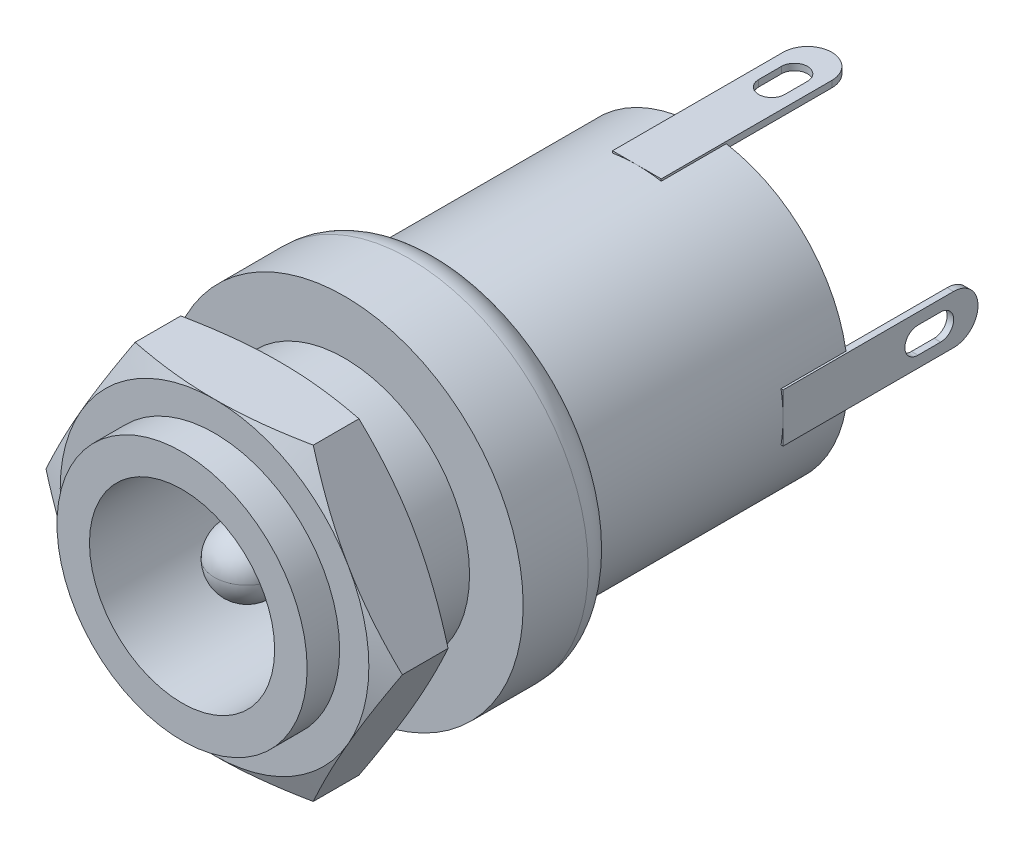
ISO-10303-21;
HEADER;
FILE_DESCRIPTION(('STEP AP214'),'2;1');
FILE_NAME('part.step','',(''),(''),'','','');
FILE_SCHEMA(('AUTOMOTIVE_DESIGN { 1 0 10303 214 1 1 1 1 }'));
ENDSEC;
DATA;
#1=APPLICATION_CONTEXT('core data for automotive mechanical design processes');
#2=APPLICATION_PROTOCOL_DEFINITION('international standard','automotive_design',2000,#1);
#3=PRODUCT_CONTEXT('',#1,'mechanical');
#4=PRODUCT('Part','Part','',(#3));
#5=PRODUCT_RELATED_PRODUCT_CATEGORY('part','',(#4));
#6=PRODUCT_DEFINITION_FORMATION('','',#4);
#7=PRODUCT_DEFINITION_CONTEXT('part definition',#1,'design');
#8=PRODUCT_DEFINITION('design','',#6,#7);
#9=PRODUCT_DEFINITION_SHAPE('','',#8);
#10=(LENGTH_UNIT() NAMED_UNIT(*) SI_UNIT(.MILLI.,.METRE.));
#11=(NAMED_UNIT(*) PLANE_ANGLE_UNIT() SI_UNIT($,.RADIAN.));
#12=(NAMED_UNIT(*) SI_UNIT($,.STERADIAN.) SOLID_ANGLE_UNIT());
#13=UNCERTAINTY_MEASURE_WITH_UNIT(LENGTH_MEASURE(1.E-05),#10,'distance_accuracy_value','');
#14=(GEOMETRIC_REPRESENTATION_CONTEXT(3) GLOBAL_UNCERTAINTY_ASSIGNED_CONTEXT((#13)) GLOBAL_UNIT_ASSIGNED_CONTEXT((#10,
#11,#12)) REPRESENTATION_CONTEXT('',''));
#15=CARTESIAN_POINT('',(0.,0.,0.));
#16=DIRECTION('',(0.,0.,1.));
#17=DIRECTION('',(1.,0.,0.));
#18=AXIS2_PLACEMENT_3D('',#15,#16,#17);
#19=CARTESIAN_POINT('',(0.,0.,3.));
#20=DIRECTION('',(-1.,1.488401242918E-10,0.));
#21=DIRECTION('',(-1.488401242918E-10,-1.,0.));
#22=AXIS2_PLACEMENT_3D('',#19,#20,#21);
#23=SPHERICAL_SURFACE('',#22,1.);
#24=CARTESIAN_POINT('',(-1.,1.48840010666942E-10,3.));
#25=CARTESIAN_POINT('',(-1.00000034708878,-3.42917153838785E-08,3.01636247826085));
#26=CARTESIAN_POINT('',(-0.999598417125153,-6.76524079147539E-08,3.03272492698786));
#27=CARTESIAN_POINT('',(-0.997992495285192,-1.32144611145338E-07,3.06541042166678));
#28=CARTESIAN_POINT('',(-0.996788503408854,-1.63276121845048E-07,3.08173346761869));
#29=CARTESIAN_POINT('',(-0.99358094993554,-2.23240505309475E-07,3.11430081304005));
#30=CARTESIAN_POINT('',(-0.991577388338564,-2.52073378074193E-07,3.13054511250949));
#31=CARTESIAN_POINT('',(-0.986775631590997,-3.07384554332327E-07,3.1629158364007));
#32=CARTESIAN_POINT('',(-0.983977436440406,-3.33862857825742E-07,3.17904226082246));
#33=CARTESIAN_POINT('',(-0.977593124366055,-3.844190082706E-07,3.21113838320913));
#34=CARTESIAN_POINT('',(-0.974007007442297,-4.08496855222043E-07,3.22710808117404));
#35=CARTESIAN_POINT('',(-0.966055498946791,-4.54217277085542E-07,3.25885227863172));
#36=CARTESIAN_POINT('',(-0.961690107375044,-4.75859851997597E-07,3.2746267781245));
#37=CARTESIAN_POINT('',(-0.952190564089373,-5.16685756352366E-07,3.30594257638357));
#38=CARTESIAN_POINT('',(-0.947056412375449,-5.35869085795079E-07,3.32148387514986));
#39=CARTESIAN_POINT('',(-0.936031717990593,-5.71763427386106E-07,3.35229583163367));
#40=CARTESIAN_POINT('',(-0.930141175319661,-5.8847443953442E-07,3.36756648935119));
#41=CARTESIAN_POINT('',(-0.917617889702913,-6.19421908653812E-07,3.39780037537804));
#42=CARTESIAN_POINT('',(-0.910985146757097,-6.3365836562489E-07,3.41276360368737));
#43=CARTESIAN_POINT('',(-0.89699343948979,-6.59665239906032E-07,3.44234658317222));
#44=CARTESIAN_POINT('',(-0.889634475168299,-6.71435657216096E-07,3.45696633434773));
#45=CARTESIAN_POINT('',(-0.874208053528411,-6.92529595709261E-07,3.48582713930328));
#46=CARTESIAN_POINT('',(-0.866140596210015,-7.01853116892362E-07,3.50006819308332));
#47=CARTESIAN_POINT('',(-0.849316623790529,-7.18082874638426E-07,3.52813729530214));
#48=CARTESIAN_POINT('',(-0.840560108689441,-7.24989111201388E-07,3.54196534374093));
#49=CARTESIAN_POINT('',(-0.82237911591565,-7.36424182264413E-07,3.56917512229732));
#50=CARTESIAN_POINT('',(-0.812954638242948,-7.40953016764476E-07,3.58255685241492));
#51=CARTESIAN_POINT('',(-0.793460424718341,-7.47683205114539E-07,3.60884175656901));
#52=CARTESIAN_POINT('',(-0.783390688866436,-7.49884558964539E-07,3.6217449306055));
#53=CARTESIAN_POINT('',(-0.762630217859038,-7.52019479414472E-07,3.6470416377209));
#54=CARTESIAN_POINT('',(-0.751939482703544,-7.51953046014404E-07,3.65943517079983));
#55=CARTESIAN_POINT('',(-0.729962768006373,-7.49621557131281E-07,3.68368273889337));
#56=CARTESIAN_POINT('',(-0.718676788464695,-7.47356501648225E-07,3.695536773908));
#57=CARTESIAN_POINT('',(-0.6955367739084,-7.40706072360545E-07,3.71867678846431));
#58=CARTESIAN_POINT('',(-0.683682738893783,-7.36320698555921E-07,3.729962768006));
#59=CARTESIAN_POINT('',(-0.659435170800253,-7.25516710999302E-07,3.7519394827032));
#60=CARTESIAN_POINT('',(-0.647041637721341,-7.19098097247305E-07,3.7626302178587));
#61=CARTESIAN_POINT('',(-0.62174493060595,-7.04323088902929E-07,3.78339068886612));
#62=CARTESIAN_POINT('',(-0.608841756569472,-6.95966694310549E-07,3.79346042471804));
#63=CARTESIAN_POINT('',(-0.582556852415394,-6.77419541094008E-07,3.81295463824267));
#64=CARTESIAN_POINT('',(-0.569175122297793,-6.67228782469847E-07,3.82237911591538));
#65=CARTESIAN_POINT('',(-0.541965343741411,-6.45123826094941E-07,3.84056010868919));
#66=CARTESIAN_POINT('',(-0.528137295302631,-6.33209628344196E-07,3.84931662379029));
#67=CARTESIAN_POINT('',(-0.500068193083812,-6.0777575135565E-07,3.8661405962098));
#68=CARTESIAN_POINT('',(-0.485827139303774,-5.94256072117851E-07,3.87420805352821));
#69=CARTESIAN_POINT('',(-0.456966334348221,-5.65735723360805E-07,3.88963447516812));
#70=CARTESIAN_POINT('',(-0.442346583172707,-5.50735053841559E-07,3.89699343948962));
#71=CARTESIAN_POINT('',(-0.412763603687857,-5.19383227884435E-07,3.91098514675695));
#72=CARTESIAN_POINT('',(-0.397800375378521,-5.03032071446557E-07,3.91761788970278));
#73=CARTESIAN_POINT('',(-0.367566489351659,-4.69115245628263E-07,3.93014117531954));
#74=CARTESIAN_POINT('',(-0.352295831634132,-4.51549576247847E-07,3.93603171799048));
#75=CARTESIAN_POINT('',(-0.321483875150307,-4.15344608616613E-07,3.94705641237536));
#76=CARTESIAN_POINT('',(-0.305942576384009,-3.96705310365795E-07,3.95219056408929));
#77=CARTESIAN_POINT('',(-0.274626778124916,-3.5849830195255E-07,3.96169010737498));
#78=CARTESIAN_POINT('',(-0.258852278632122,-3.38930591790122E-07,3.96605549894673));
#79=CARTESIAN_POINT('',(-0.227108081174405,-2.99015719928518E-07,3.97400700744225));
#80=CARTESIAN_POINT('',(-0.211138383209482,-2.78668558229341E-07,3.97759312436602));
#81=CARTESIAN_POINT('',(-0.179042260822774,-2.37346877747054E-07,3.98397743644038));
#82=CARTESIAN_POINT('',(-0.162915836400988,-2.16372358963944E-07,3.98677563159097));
#83=CARTESIAN_POINT('',(-0.130545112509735,-1.73950593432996E-07,3.99157738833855));
#84=CARTESIAN_POINT('',(-0.114300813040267,-1.52503346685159E-07,3.99358094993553));
#85=CARTESIAN_POINT('',(-0.0817334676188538,-1.09292609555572E-07,3.99678850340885));
#86=CARTESIAN_POINT('',(-0.0654104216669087,-8.75291191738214E-08,3.99799249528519));
#87=CARTESIAN_POINT('',(-0.0327249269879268,-4.38438185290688E-08,3.99959841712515));
#88=CARTESIAN_POINT('',(-0.01636247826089,-2.19220082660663E-08,4.00000034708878));
#89=CARTESIAN_POINT('',(0.,0.,4.));
#90=B_SPLINE_CURVE_WITH_KNOTS('',3,(#24,#25,#26,#27,#28,#29,#30,#31,#32,#33,#34,#35,#36,#37,#38,
#39,#40,#41,#42,#43,#44,#45,#46,#47,#48,#49,#50,#51,#52,#53,#54,#55,#56,#57,#58,#59,#60,#61,#62,
#63,#64,#65,#66,#67,#68,#69,#70,#71,#72,#73,#74,#75,#76,#77,#78,#79,#80,#81,#82,#83,#84,#85,#86,
#87,#88,#89),.UNSPECIFIED.,.F.,.F.,(4,2,2,2,2,2,2,2,2,2,2,2,2,2,2,2,2,2,2,2,2,2,2,2,2,2,2,2,2,2,
2,2,4),(0.,0.0490824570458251,0.0981649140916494,0.147247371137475,0.196329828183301,
0.245412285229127,0.294494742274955,0.343577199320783,0.392659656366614,0.441742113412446,
0.49082457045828,0.539907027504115,0.588989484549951,0.638071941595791,0.687154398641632,
0.736236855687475,0.785319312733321,0.834401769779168,0.883484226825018,0.93256668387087,
0.981649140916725,1.03073159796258,1.07981405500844,1.1288965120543,1.17797896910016,
1.22706142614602,1.27614388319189,1.32522634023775,1.37430879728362,1.42339125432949,
1.47247371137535,1.52155616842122,1.57063862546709),.UNSPECIFIED.);
#91=CARTESIAN_POINT('',(-1.,3.72100945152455E-11,3.));
#92=VERTEX_POINT('',#91);
#93=CARTESIAN_POINT('',(0.,0.,4.));
#94=VERTEX_POINT('',#93);
#95=EDGE_CURVE('E248',#92,#94,#90,.T.);
#96=ORIENTED_EDGE('',*,*,#95,.F.);
#97=CARTESIAN_POINT('',(0.,0.,3.));
#98=DIRECTION('',(0.,0.,1.));
#99=DIRECTION('',(1.,0.,0.));
#100=AXIS2_PLACEMENT_3D('',#97,#98,#99);
#101=CIRCLE('',#100,1.);
#102=CARTESIAN_POINT('',(1.,-5.58150040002E-11,3.));
#103=VERTEX_POINT('',#102);
#104=EDGE_CURVE('E591',#103,#92,#101,.F.);
#105=ORIENTED_EDGE('',*,*,#104,.F.);
#106=CARTESIAN_POINT('',(0.,0.,4.));
#107=CARTESIAN_POINT('',(0.0163624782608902,2.19220081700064E-08,4.00000034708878));
#108=CARTESIAN_POINT('',(0.0327249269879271,4.38438185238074E-08,3.99959841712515));
#109=CARTESIAN_POINT('',(0.0654104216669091,8.7529119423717E-08,3.99799249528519));
#110=CARTESIAN_POINT('',(0.0817334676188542,1.09292609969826E-07,3.99678850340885));
#111=CARTESIAN_POINT('',(0.114300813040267,1.52503346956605E-07,3.99358094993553));
#112=CARTESIAN_POINT('',(0.130545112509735,1.73950593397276E-07,3.99157738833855));
#113=CARTESIAN_POINT('',(0.162915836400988,2.1637235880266E-07,3.98677563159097));
#114=CARTESIAN_POINT('',(0.179042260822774,2.37346877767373E-07,3.98397743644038));
#115=CARTESIAN_POINT('',(0.211138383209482,2.78668558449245E-07,3.97759312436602));
#116=CARTESIAN_POINT('',(0.227108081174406,2.99015720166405E-07,3.97400700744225));
#117=CARTESIAN_POINT('',(0.258852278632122,3.38930591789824E-07,3.96605549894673));
#118=CARTESIAN_POINT('',(0.274626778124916,3.58498301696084E-07,3.96169010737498));
#119=CARTESIAN_POINT('',(0.305942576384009,3.96705310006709E-07,3.95219056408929));
#120=CARTESIAN_POINT('',(0.321483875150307,4.15344608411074E-07,3.94705641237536));
#121=CARTESIAN_POINT('',(0.352295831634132,4.51549576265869E-07,3.93603171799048));
#122=CARTESIAN_POINT('',(0.367566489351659,4.691152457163E-07,3.93014117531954));
#123=CARTESIAN_POINT('',(0.397800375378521,5.03032071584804E-07,3.91761788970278));
#124=CARTESIAN_POINT('',(0.412763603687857,5.19383228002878E-07,3.91098514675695));
#125=CARTESIAN_POINT('',(0.442346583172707,5.50735053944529E-07,3.89699343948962));
#126=CARTESIAN_POINT('',(0.456966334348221,5.65735723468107E-07,3.88963447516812));
#127=CARTESIAN_POINT('',(0.485827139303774,5.94256072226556E-07,3.87420805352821));
#128=CARTESIAN_POINT('',(0.500068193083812,6.07775751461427E-07,3.8661405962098));
#129=CARTESIAN_POINT('',(0.528137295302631,6.33209628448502E-07,3.84931662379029));
#130=CARTESIAN_POINT('',(0.541965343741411,6.45123826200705E-07,3.84056010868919));
#131=CARTESIAN_POINT('',(0.569175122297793,6.67228782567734E-07,3.82237911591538));
#132=CARTESIAN_POINT('',(0.582556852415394,6.77419541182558E-07,3.81295463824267));
#133=CARTESIAN_POINT('',(0.608841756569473,6.95966694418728E-07,3.79346042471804));
#134=CARTESIAN_POINT('',(0.62174493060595,7.04323089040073E-07,3.78339068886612));
#135=CARTESIAN_POINT('',(0.647041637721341,7.19098097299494E-07,3.7626302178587));
#136=CARTESIAN_POINT('',(0.659435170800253,7.2551671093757E-07,3.75193948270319));
#137=CARTESIAN_POINT('',(0.683682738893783,7.36320698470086E-07,3.729962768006));
#138=CARTESIAN_POINT('',(0.6955367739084,7.40706072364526E-07,3.71867678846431));
#139=CARTESIAN_POINT('',(0.718676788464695,7.47356501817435E-07,3.695536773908));
#140=CARTESIAN_POINT('',(0.729962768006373,7.49621557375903E-07,3.68368273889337));
#141=CARTESIAN_POINT('',(0.751939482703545,7.51953046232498E-07,3.65943517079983));
#142=CARTESIAN_POINT('',(0.762630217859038,7.52019479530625E-07,3.6470416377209));
#143=CARTESIAN_POINT('',(0.783390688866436,7.49884559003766E-07,3.6217449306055));
#144=CARTESIAN_POINT('',(0.793460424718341,7.47683205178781E-07,3.60884175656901));
#145=CARTESIAN_POINT('',(0.812954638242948,7.40953016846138E-07,3.58255685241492));
#146=CARTESIAN_POINT('',(0.82237911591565,7.36424182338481E-07,3.56917512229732));
#147=CARTESIAN_POINT('',(0.840560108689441,7.24989111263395E-07,3.54196534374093));
#148=CARTESIAN_POINT('',(0.849316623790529,7.18082874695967E-07,3.52813729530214));
#149=CARTESIAN_POINT('',(0.866140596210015,7.0185311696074E-07,3.50006819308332));
#150=CARTESIAN_POINT('',(0.874208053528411,6.92529595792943E-07,3.48582713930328));
#151=CARTESIAN_POINT('',(0.889634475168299,6.71435657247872E-07,3.45696633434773));
#152=CARTESIAN_POINT('',(0.89699343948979,6.59665239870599E-07,3.44234658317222));
#153=CARTESIAN_POINT('',(0.910985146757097,6.3365836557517E-07,3.41276360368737));
#154=CARTESIAN_POINT('',(0.917617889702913,6.19421908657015E-07,3.39780037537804));
#155=CARTESIAN_POINT('',(0.930141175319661,5.88474439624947E-07,3.36756648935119));
#156=CARTESIAN_POINT('',(0.936031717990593,5.71763427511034E-07,3.35229583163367));
#157=CARTESIAN_POINT('',(0.947056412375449,5.35869085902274E-07,3.32148387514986));
#158=CARTESIAN_POINT('',(0.952190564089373,5.16685756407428E-07,3.30594257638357));
#159=CARTESIAN_POINT('',(0.961690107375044,4.75859852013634E-07,3.2746267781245));
#160=CARTESIAN_POINT('',(0.966055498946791,4.54217277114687E-07,3.25885227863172));
#161=CARTESIAN_POINT('',(0.974007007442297,4.0849685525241E-07,3.22710808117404));
#162=CARTESIAN_POINT('',(0.977593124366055,3.8441900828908E-07,3.21113838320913));
#163=CARTESIAN_POINT('',(0.983977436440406,3.33862857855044E-07,3.17904226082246));
#164=CARTESIAN_POINT('',(0.986775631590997,3.07384554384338E-07,3.1629158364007));
#165=CARTESIAN_POINT('',(0.991577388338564,2.52073378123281E-07,3.13054511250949));
#166=CARTESIAN_POINT('',(0.99358094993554,2.2324050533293E-07,3.11430081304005));
#167=CARTESIAN_POINT('',(0.996788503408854,1.63276121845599E-07,3.08173346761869));
#168=CARTESIAN_POINT('',(0.997992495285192,1.32144611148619E-07,3.06541042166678));
#169=CARTESIAN_POINT('',(0.999598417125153,6.76524079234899E-08,3.03272492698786));
#170=CARTESIAN_POINT('',(1.00000034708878,3.42917153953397E-08,3.01636247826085));
#171=CARTESIAN_POINT('',(1.,-1.488400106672E-10,3.));
#172=B_SPLINE_CURVE_WITH_KNOTS('',3,(#106,#107,#108,#109,#110,#111,#112,#113,#114,#115,#116,
#117,#118,#119,#120,#121,#122,#123,#124,#125,#126,#127,#128,#129,#130,#131,#132,#133,#134,#135,
#136,#137,#138,#139,#140,#141,#142,#143,#144,#145,#146,#147,#148,#149,#150,#151,#152,#153,#154,
#155,#156,#157,#158,#159,#160,#161,#162,#163,#164,#165,#166,#167,#168,#169,#170,#171),
.UNSPECIFIED.,.F.,.F.,(4,2,2,2,2,2,2,2,2,2,2,2,2,2,2,2,2,2,2,2,2,2,2,2,2,2,2,2,2,2,2,2,4),(0.,
0.0490824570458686,0.0981649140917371,0.147247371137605,0.196329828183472,0.245412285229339,
0.294494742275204,0.343577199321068,0.392659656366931,0.441742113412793,0.490824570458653,
0.53990702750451,0.588989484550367,0.63807194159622,0.687154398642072,0.736236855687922,
0.78531931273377,0.834401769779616,0.883484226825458,0.9325666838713,0.981649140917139,
1.03073159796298,1.07981405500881,1.12889651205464,1.17797896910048,1.22706142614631,
1.27614388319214,1.32522634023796,1.37430879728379,1.42339125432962,1.47247371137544,
1.52155616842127,1.57063862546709),.UNSPECIFIED.);
#173=EDGE_CURVE('E609',#94,#103,#172,.T.);
#174=ORIENTED_EDGE('',*,*,#173,.F.);
#175=EDGE_LOOP('',(#96,#105,#174));
#176=FACE_BOUND('',#175,.T.);
#177=ADVANCED_FACE('F16',(#176),#23,.T.);
#178=CARTESIAN_POINT('',(0.,0.,3.));
#179=DIRECTION('',(1.,-1.488400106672E-10,0.));
#180=DIRECTION('',(1.488400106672E-10,1.,0.));
#181=AXIS2_PLACEMENT_3D('',#178,#179,#180);
#182=SPHERICAL_SURFACE('',#181,1.);
#183=ORIENTED_EDGE('',*,*,#173,.T.);
#184=CARTESIAN_POINT('',(0.,0.,3.));
#185=DIRECTION('',(0.,0.,1.));
#186=DIRECTION('',(1.,0.,0.));
#187=AXIS2_PLACEMENT_3D('',#184,#185,#186);
#188=CIRCLE('',#187,1.);
#189=EDGE_CURVE('E906',#92,#103,#188,.F.);
#190=ORIENTED_EDGE('',*,*,#189,.F.);
#191=ORIENTED_EDGE('',*,*,#95,.T.);
#192=EDGE_LOOP('',(#183,#190,#191));
#193=FACE_BOUND('',#192,.T.);
#194=ADVANCED_FACE('F593',(#193),#182,.T.);
#195=CARTESIAN_POINT('',(0.,0.,0.));
#196=DIRECTION('',(0.,0.,1.));
#197=DIRECTION('',(1.,0.,0.));
#198=AXIS2_PLACEMENT_3D('',#195,#196,#197);
#199=CYLINDRICAL_SURFACE('',#198,1.);
#200=CARTESIAN_POINT('',(0.,0.,0.));
#201=DIRECTION('',(0.,0.,1.));
#202=DIRECTION('',(1.,0.,0.));
#203=AXIS2_PLACEMENT_3D('',#200,#201,#202);
#204=CIRCLE('',#203,1.);
#205=CARTESIAN_POINT('',(1.,0.,0.));
#206=VERTEX_POINT('',#205);
#207=EDGE_CURVE('E20',#206,#206,#204,.F.);
#208=ORIENTED_EDGE('',*,*,#207,.F.);
#209=EDGE_LOOP('',(#208));
#210=FACE_BOUND('',#209,.T.);
#211=ORIENTED_EDGE('',*,*,#189,.T.);
#212=ORIENTED_EDGE('',*,*,#104,.T.);
#213=EDGE_LOOP('',(#211,#212));
#214=FACE_BOUND('',#213,.T.);
#215=ADVANCED_FACE('F597',(#210,#214),#199,.T.);
#216=CARTESIAN_POINT('',(0.,0.,0.));
#217=DIRECTION('',(0.,0.,1.));
#218=DIRECTION('',(1.,0.,0.));
#219=AXIS2_PLACEMENT_3D('',#216,#217,#218);
#220=PLANE('',#219);
#221=ORIENTED_EDGE('',*,*,#207,.T.);
#222=EDGE_LOOP('',(#221));
#223=FACE_BOUND('',#222,.T.);
#224=CARTESIAN_POINT('',(0.,0.,0.));
#225=DIRECTION('',(0.,0.,1.));
#226=DIRECTION('',(1.,0.,0.));
#227=AXIS2_PLACEMENT_3D('',#224,#225,#226);
#228=CIRCLE('',#227,2.85);
#229=CARTESIAN_POINT('',(2.85,0.,0.));
#230=VERTEX_POINT('',#229);
#231=EDGE_CURVE('E901',#230,#230,#228,.T.);
#232=ORIENTED_EDGE('',*,*,#231,.T.);
#233=EDGE_LOOP('',(#232));
#234=FACE_BOUND('',#233,.T.);
#235=ADVANCED_FACE('F918',(#223,#234),#220,.T.);
#236=CARTESIAN_POINT('',(0.,0.,0.));
#237=DIRECTION('',(0.,0.,1.));
#238=DIRECTION('',(1.,0.,0.));
#239=AXIS2_PLACEMENT_3D('',#236,#237,#238);
#240=CYLINDRICAL_SURFACE('',#239,2.85);
#241=CARTESIAN_POINT('',(0.,0.,5.));
#242=DIRECTION('',(0.,0.,1.));
#243=DIRECTION('',(1.,0.,0.));
#244=AXIS2_PLACEMENT_3D('',#241,#242,#243);
#245=CIRCLE('',#244,2.85);
#246=CARTESIAN_POINT('',(2.85,0.,5.));
#247=VERTEX_POINT('',#246);
#248=EDGE_CURVE('E899',#247,#247,#245,.F.);
#249=ORIENTED_EDGE('',*,*,#248,.F.);
#250=EDGE_LOOP('',(#249));
#251=FACE_BOUND('',#250,.T.);
#252=ORIENTED_EDGE('',*,*,#231,.F.);
#253=EDGE_LOOP('',(#252));
#254=FACE_BOUND('',#253,.T.);
#255=ADVANCED_FACE('F924',(#251,#254),#240,.F.);
#256=CARTESIAN_POINT('',(0.,0.,5.));
#257=DIRECTION('',(0.,0.,1.));
#258=DIRECTION('',(1.,0.,0.));
#259=AXIS2_PLACEMENT_3D('',#256,#257,#258);
#260=PLANE('',#259);
#261=ORIENTED_EDGE('',*,*,#248,.T.);
#262=EDGE_LOOP('',(#261));
#263=FACE_BOUND('',#262,.T.);
#264=CARTESIAN_POINT('',(0.,0.,5.));
#265=DIRECTION('',(0.,0.,1.));
#266=DIRECTION('',(1.,0.,0.));
#267=AXIS2_PLACEMENT_3D('',#264,#265,#266);
#268=CIRCLE('',#267,3.85);
#269=CARTESIAN_POINT('',(3.85,0.,5.));
#270=VERTEX_POINT('',#269);
#271=EDGE_CURVE('E896',#270,#270,#268,.F.);
#272=ORIENTED_EDGE('',*,*,#271,.F.);
#273=EDGE_LOOP('',(#272));
#274=FACE_BOUND('',#273,.T.);
#275=ADVANCED_FACE('F1221',(#263,#274),#260,.T.);
#276=CARTESIAN_POINT('',(0.,0.,0.));
#277=DIRECTION('',(0.,0.,1.));
#278=DIRECTION('',(1.,0.,0.));
#279=AXIS2_PLACEMENT_3D('',#276,#277,#278);
#280=CYLINDRICAL_SURFACE('',#279,3.85);
#281=ORIENTED_EDGE('',*,*,#271,.T.);
#282=EDGE_LOOP('',(#281));
#283=FACE_BOUND('',#282,.T.);
#284=CARTESIAN_POINT('',(0.,0.,4.));
#285=DIRECTION('',(0.,0.,1.));
#286=DIRECTION('',(1.,0.,0.));
#287=AXIS2_PLACEMENT_3D('',#284,#285,#286);
#288=CIRCLE('',#287,3.85);
#289=CARTESIAN_POINT('',(3.85,0.,4.));
#290=VERTEX_POINT('',#289);
#291=EDGE_CURVE('E893',#290,#290,#288,.F.);
#292=ORIENTED_EDGE('',*,*,#291,.F.);
#293=EDGE_LOOP('',(#292));
#294=FACE_BOUND('',#293,.T.);
#295=ADVANCED_FACE('F1215',(#283,#294),#280,.T.);
#296=CARTESIAN_POINT('',(0.,0.,4.));
#297=DIRECTION('',(0.,0.,1.));
#298=DIRECTION('',(1.,0.,0.));
#299=AXIS2_PLACEMENT_3D('',#296,#297,#298);
#300=PLANE('',#299);
#301=ORIENTED_EDGE('',*,*,#291,.T.);
#302=EDGE_LOOP('',(#301));
#303=FACE_BOUND('',#302,.T.);
#304=CARTESIAN_POINT('',(0.,0.,3.99999999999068));
#305=DIRECTION('',(0.,0.,-1.));
#306=DIRECTION('',(-1.,0.,0.));
#307=AXIS2_PLACEMENT_3D('',#304,#305,#306);
#308=CIRCLE('',#307,4.75000000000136);
#309=CARTESIAN_POINT('',(-4.11362066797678,2.37500000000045,3.99999999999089));
#310=VERTEX_POINT('',#309);
#311=CARTESIAN_POINT('',(0.,4.75000000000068,3.99999999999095));
#312=VERTEX_POINT('',#311);
#313=EDGE_CURVE('E883',#310,#312,#308,.T.);
#314=ORIENTED_EDGE('',*,*,#313,.F.);
#315=CARTESIAN_POINT('',(0.,0.,3.99999999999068));
#316=DIRECTION('',(0.,0.,-1.));
#317=DIRECTION('',(-1.,0.,0.));
#318=AXIS2_PLACEMENT_3D('',#315,#316,#317);
#319=CIRCLE('',#318,4.75000000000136);
#320=CARTESIAN_POINT('',(-4.11362066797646,-2.37500000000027,3.99999999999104));
#321=VERTEX_POINT('',#320);
#322=EDGE_CURVE('E239',#321,#310,#319,.T.);
#323=ORIENTED_EDGE('',*,*,#322,.F.);
#324=CARTESIAN_POINT('',(0.,0.,3.99999999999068));
#325=DIRECTION('',(0.,0.,-1.));
#326=DIRECTION('',(-1.,0.,0.));
#327=AXIS2_PLACEMENT_3D('',#324,#325,#326);
#328=CIRCLE('',#327,4.75000000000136);
#329=CARTESIAN_POINT('',(0.,-4.75000000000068,3.99999999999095));
#330=VERTEX_POINT('',#329);
#331=EDGE_CURVE('E235',#330,#321,#328,.T.);
#332=ORIENTED_EDGE('',*,*,#331,.F.);
#333=CARTESIAN_POINT('',(0.,0.,3.99999999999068));
#334=DIRECTION('',(0.,0.,-1.));
#335=DIRECTION('',(-1.,0.,0.));
#336=AXIS2_PLACEMENT_3D('',#333,#334,#335);
#337=CIRCLE('',#336,4.75000000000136);
#338=CARTESIAN_POINT('',(4.11362066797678,-2.37500000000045,3.99999999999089));
#339=VERTEX_POINT('',#338);
#340=EDGE_CURVE('E886',#339,#330,#337,.T.);
#341=ORIENTED_EDGE('',*,*,#340,.F.);
#342=CARTESIAN_POINT('',(0.,0.,3.99999999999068));
#343=DIRECTION('',(0.,0.,-1.));
#344=DIRECTION('',(-1.,0.,0.));
#345=AXIS2_PLACEMENT_3D('',#342,#343,#344);
#346=CIRCLE('',#345,4.75000000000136);
#347=CARTESIAN_POINT('',(4.11362066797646,2.37500000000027,3.99999999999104));
#348=VERTEX_POINT('',#347);
#349=EDGE_CURVE('E880',#348,#339,#346,.T.);
#350=ORIENTED_EDGE('',*,*,#349,.F.);
#351=CARTESIAN_POINT('',(0.,0.,3.99999999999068));
#352=DIRECTION('',(0.,0.,-1.));
#353=DIRECTION('',(-1.,0.,0.));
#354=AXIS2_PLACEMENT_3D('',#351,#352,#353);
#355=CIRCLE('',#354,4.75000000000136);
#356=EDGE_CURVE('E879',#312,#348,#355,.T.);
#357=ORIENTED_EDGE('',*,*,#356,.F.);
#358=EDGE_LOOP('',(#314,#323,#332,#341,#350,#357));
#359=FACE_BOUND('',#358,.T.);
#360=ADVANCED_FACE('F1212',(#303,#359),#300,.T.);
#361=CARTESIAN_POINT('',(0.,0.,3.70132905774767));
#362=DIRECTION('',(0.,0.,-1.));
#363=DIRECTION('',(-1.,0.,0.));
#364=AXIS2_PLACEMENT_3D('',#361,#362,#363);
#365=CONICAL_SURFACE('',#364,5.48923652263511,1.18682389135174);
#366=CARTESIAN_POINT('',(0.,-4.75,3.99999999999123));
#367=CARTESIAN_POINT('',(-0.115317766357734,-4.75,4.00001112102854));
#368=CARTESIAN_POINT('',(-0.230633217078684,-4.75,3.99830356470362));
#369=CARTESIAN_POINT('',(-0.461156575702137,-4.75,3.99153325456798));
#370=CARTESIAN_POINT('',(-0.576364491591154,-4.75,3.98647077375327));
#371=CARTESIAN_POINT('',(-0.806298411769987,-4.75,3.97308963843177));
#372=CARTESIAN_POINT('',(-0.92102489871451,-4.75,3.96477922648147));
#373=CARTESIAN_POINT('',(-1.15020974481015,-4.75,3.94505469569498));
#374=CARTESIAN_POINT('',(-1.26466810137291,-4.75,3.93364054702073));
#375=CARTESIAN_POINT('',(-1.60740545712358,-4.75,3.89503048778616));
#376=CARTESIAN_POINT('',(-1.83519287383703,-4.75,3.86345802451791));
#377=CARTESIAN_POINT('',(-2.28976975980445,-4.75,3.79033311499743));
#378=CARTESIAN_POINT('',(-2.51655519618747,-4.75,3.74875539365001));
#379=CARTESIAN_POINT('',(-2.74241377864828,-4.75,3.70311039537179));
#380=B_SPLINE_CURVE_WITH_KNOTS('',3,(#366,#367,#368,#369,#370,#371,#372,#373,#374,#375,#376,
#377,#378,#379),.UNSPECIFIED.,.F.,.F.,(4,2,2,2,2,2,4),(0.,0.345936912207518,0.691845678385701,
1.03688224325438,1.3819221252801,2.0715632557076,2.76296517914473),.UNSPECIFIED.);
#381=CARTESIAN_POINT('',(-2.74241377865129,-4.74999999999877,3.70311039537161));
#382=VERTEX_POINT('',#381);
#383=EDGE_CURVE('E582',#330,#382,#380,.T.);
#384=ORIENTED_EDGE('',*,*,#383,.F.);
#385=ORIENTED_EDGE('',*,*,#331,.T.);
#386=CARTESIAN_POINT('',(-2.74241377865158,-4.74999999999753,3.70311039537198));
#387=CARTESIAN_POINT('',(-2.85534306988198,-4.55440072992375,3.74875539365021));
#388=CARTESIAN_POINT('',(-2.96873578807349,-4.35799878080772,3.79033311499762));
#389=CARTESIAN_POINT('',(-3.19602423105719,-3.96432364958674,3.86345802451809));
#390=CARTESIAN_POINT('',(-3.30991793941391,-3.76705396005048,3.89503048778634));
#391=CARTESIAN_POINT('',(-3.48128661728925,-3.47023470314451,3.93364054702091));
#392=CARTESIAN_POINT('',(-3.53851579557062,-3.37111085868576,3.94505469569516));
#393=CARTESIAN_POINT('',(-3.65310821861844,-3.17263095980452,3.96477922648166));
#394=CARTESIAN_POINT('',(-3.7104714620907,-3.07327490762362,3.97308963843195));
#395=CARTESIAN_POINT('',(-3.82543842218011,-2.87414629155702,3.98647077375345));
#396=CARTESIAN_POINT('',(-3.88304238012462,-2.77437330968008,3.99153325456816));
#397=CARTESIAN_POINT('',(-3.99830405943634,-2.57473422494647,3.9983035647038));
#398=CARTESIAN_POINT('',(-4.05596178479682,-2.47486811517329,4.00001112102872));
#399=CARTESIAN_POINT('',(-4.11362066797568,-2.37499999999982,3.99999999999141));
#400=B_SPLINE_CURVE_WITH_KNOTS('',3,(#386,#387,#388,#389,#390,#391,#392,#393,#394,#395,#396,
#397,#398,#399),.UNSPECIFIED.,.F.,.F.,(4,2,2,2,2,2,4),(0.,0.691401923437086,1.38104305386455,
1.72608293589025,2.07111950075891,2.41702826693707,2.76296517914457),.UNSPECIFIED.);
#401=EDGE_CURVE('E586',#382,#321,#400,.T.);
#402=ORIENTED_EDGE('',*,*,#401,.F.);
#403=EDGE_LOOP('',(#384,#385,#402));
#404=FACE_BOUND('',#403,.T.);
#405=ADVANCED_FACE('F556',(#404),#365,.T.);
#406=CARTESIAN_POINT('',(0.,0.,3.70132905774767));
#407=DIRECTION('',(0.,0.,-1.));
#408=DIRECTION('',(-1.,0.,0.));
#409=AXIS2_PLACEMENT_3D('',#406,#407,#408);
#410=CONICAL_SURFACE('',#409,5.48923652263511,1.18682389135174);
#411=CARTESIAN_POINT('',(4.11362066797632,-2.37500000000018,3.99999999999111));
#412=CARTESIAN_POINT('',(4.05596178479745,-2.47486811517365,4.00001112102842));
#413=CARTESIAN_POINT('',(3.99830405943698,-2.57473422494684,3.9983035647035));
#414=CARTESIAN_POINT('',(3.88304238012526,-2.77437330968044,3.99153325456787));
#415=CARTESIAN_POINT('',(3.82543842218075,-2.87414629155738,3.98647077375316));
#416=CARTESIAN_POINT('',(3.71047146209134,-3.07327490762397,3.97308963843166));
#417=CARTESIAN_POINT('',(3.65310821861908,-3.17263095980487,3.96477922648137));
#418=CARTESIAN_POINT('',(3.53851579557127,-3.3711108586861,3.94505469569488));
#419=CARTESIAN_POINT('',(3.48128661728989,-3.47023470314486,3.93364054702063));
#420=CARTESIAN_POINT('',(3.30991793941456,-3.76705396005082,3.89503048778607));
#421=CARTESIAN_POINT('',(3.19602423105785,-3.96432364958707,3.86345802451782));
#422=CARTESIAN_POINT('',(2.96873578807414,-4.35799878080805,3.79033311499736));
#423=CARTESIAN_POINT('',(2.85534306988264,-4.55440072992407,3.74875539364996));
#424=CARTESIAN_POINT('',(2.74241377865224,-4.74999999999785,3.70311039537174));
#425=B_SPLINE_CURVE_WITH_KNOTS('',3,(#411,#412,#413,#414,#415,#416,#417,#418,#419,#420,#421,
#422,#423,#424),.UNSPECIFIED.,.F.,.F.,(4,2,2,2,2,2,4),(0.,0.34593691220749,0.691845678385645,
1.0368822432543,1.38192212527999,2.07156325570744,2.76296517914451),.UNSPECIFIED.);
#426=CARTESIAN_POINT('',(2.74241377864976,-4.75,3.70311039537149));
#427=VERTEX_POINT('',#426);
#428=EDGE_CURVE('E567',#339,#427,#425,.T.);
#429=ORIENTED_EDGE('',*,*,#428,.F.);
#430=ORIENTED_EDGE('',*,*,#340,.T.);
#431=CARTESIAN_POINT('',(2.74241377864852,-4.75,3.70311039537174));
#432=CARTESIAN_POINT('',(2.5165551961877,-4.75,3.74875539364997));
#433=CARTESIAN_POINT('',(2.28976975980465,-4.75,3.79033311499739));
#434=CARTESIAN_POINT('',(1.83519287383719,-4.75,3.86345802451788));
#435=CARTESIAN_POINT('',(1.60740545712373,-4.75,3.89503048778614));
#436=CARTESIAN_POINT('',(1.26466810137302,-4.75,3.93364054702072));
#437=CARTESIAN_POINT('',(1.15020974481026,-4.75,3.94505469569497));
#438=CARTESIAN_POINT('',(0.921024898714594,-4.75,3.96477922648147));
#439=CARTESIAN_POINT('',(0.80629841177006,-4.75,3.97308963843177));
#440=CARTESIAN_POINT('',(0.576364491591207,-4.75,3.98647077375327));
#441=CARTESIAN_POINT('',(0.46115657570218,-4.75,3.99153325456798));
#442=CARTESIAN_POINT('',(0.230633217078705,-4.75,3.99830356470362));
#443=CARTESIAN_POINT('',(0.115317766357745,-4.75,4.00001112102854));
#444=CARTESIAN_POINT('',(0.,-4.75,3.99999999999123));
#445=B_SPLINE_CURVE_WITH_KNOTS('',3,(#431,#432,#433,#434,#435,#436,#437,#438,#439,#440,#441,
#442,#443,#444),.UNSPECIFIED.,.F.,.F.,(4,2,2,2,2,2,4),(0.,0.69140192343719,1.38104305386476,
1.7260829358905,2.07111950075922,2.41702826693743,2.76296517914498),.UNSPECIFIED.);
#446=EDGE_CURVE('E562',#427,#330,#445,.T.);
#447=ORIENTED_EDGE('',*,*,#446,.F.);
#448=EDGE_LOOP('',(#429,#430,#447));
#449=FACE_BOUND('',#448,.T.);
#450=ADVANCED_FACE('F549',(#449),#410,.T.);
#451=CARTESIAN_POINT('',(0.,0.,3.70132905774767));
#452=DIRECTION('',(0.,0.,-1.));
#453=DIRECTION('',(-1.,0.,0.));
#454=AXIS2_PLACEMENT_3D('',#451,#452,#453);
#455=CONICAL_SURFACE('',#454,5.48923652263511,1.18682389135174);
#456=CARTESIAN_POINT('',(5.48482755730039,-2.51440486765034E-12,3.70311039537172));
#457=CARTESIAN_POINT('',(5.37189826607,-0.195599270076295,3.74875539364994));
#458=CARTESIAN_POINT('',(5.25850554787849,-0.392001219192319,3.79033311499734));
#459=CARTESIAN_POINT('',(5.03121710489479,-0.785676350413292,3.86345802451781));
#460=CARTESIAN_POINT('',(4.91732339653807,-0.982946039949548,3.89503048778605));
#461=CARTESIAN_POINT('',(4.74595471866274,-1.27976529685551,3.93364054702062));
#462=CARTESIAN_POINT('',(4.68872554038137,-1.37888914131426,3.94505469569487));
#463=CARTESIAN_POINT('',(4.57413311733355,-1.5773690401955,3.96477922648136));
#464=CARTESIAN_POINT('',(4.51676987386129,-1.67672509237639,3.97308963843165));
#465=CARTESIAN_POINT('',(4.40180291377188,-1.87585370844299,3.98647077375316));
#466=CARTESIAN_POINT('',(4.34419895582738,-1.97562669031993,3.99153325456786));
#467=CARTESIAN_POINT('',(4.22893727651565,-2.17526577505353,3.9983035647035));
#468=CARTESIAN_POINT('',(4.17127955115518,-2.27513188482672,4.00001112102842));
#469=CARTESIAN_POINT('',(4.11362066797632,-2.37500000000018,3.99999999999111));
#470=B_SPLINE_CURVE_WITH_KNOTS('',3,(#456,#457,#458,#459,#460,#461,#462,#463,#464,#465,#466,
#467,#468,#469),.UNSPECIFIED.,.F.,.F.,(4,2,2,2,2,2,4),(0.,0.691401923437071,1.38104305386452,
1.72608293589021,2.07111950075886,2.41702826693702,2.76296517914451),.UNSPECIFIED.);
#471=CARTESIAN_POINT('',(5.4848275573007,-1.25711554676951E-12,3.70311039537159));
#472=VERTEX_POINT('',#471);
#473=EDGE_CURVE('E538',#472,#339,#470,.T.);
#474=ORIENTED_EDGE('',*,*,#473,.F.);
#475=CARTESIAN_POINT('',(4.11362066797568,2.37499999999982,3.99999999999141));
#476=CARTESIAN_POINT('',(4.17127955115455,2.27513188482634,4.00001112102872));
#477=CARTESIAN_POINT('',(4.22893727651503,2.17526577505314,3.99830356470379));
#478=CARTESIAN_POINT('',(4.34419895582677,1.97562669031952,3.99153325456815));
#479=CARTESIAN_POINT('',(4.40180291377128,1.87585370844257,3.98647077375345));
#480=CARTESIAN_POINT('',(4.5167698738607,1.67672509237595,3.97308963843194));
#481=CARTESIAN_POINT('',(4.57413311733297,1.57736904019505,3.96477922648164));
#482=CARTESIAN_POINT('',(4.6887255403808,1.37888914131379,3.94505469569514));
#483=CARTESIAN_POINT('',(4.74595471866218,1.27976529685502,3.93364054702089));
#484=CARTESIAN_POINT('',(4.91732339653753,0.982946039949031,3.89503048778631));
#485=CARTESIAN_POINT('',(5.03121710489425,0.785676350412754,3.86345802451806));
#486=CARTESIAN_POINT('',(5.25850554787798,0.39200121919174,3.79033311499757));
#487=CARTESIAN_POINT('',(5.3718982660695,0.195599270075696,3.74875539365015));
#488=CARTESIAN_POINT('',(5.48482755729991,1.89464461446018E-12,3.70311039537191));
#489=B_SPLINE_CURVE_WITH_KNOTS('',3,(#475,#476,#477,#478,#479,#480,#481,#482,#483,#484,#485,
#486,#487,#488),.UNSPECIFIED.,.F.,.F.,(4,2,2,2,2,2,4),(0.,0.345936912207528,0.691845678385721,
1.03688224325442,1.38192212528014,2.07156325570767,2.76296517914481),.UNSPECIFIED.);
#490=EDGE_CURVE('E530',#348,#472,#489,.T.);
#491=ORIENTED_EDGE('',*,*,#490,.F.);
#492=ORIENTED_EDGE('',*,*,#349,.T.);
#493=EDGE_LOOP('',(#474,#491,#492));
#494=FACE_BOUND('',#493,.T.);
#495=ADVANCED_FACE('F543',(#494),#455,.T.);
#496=CARTESIAN_POINT('',(0.,0.,3.70132905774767));
#497=DIRECTION('',(0.,0.,-1.));
#498=DIRECTION('',(-1.,0.,0.));
#499=AXIS2_PLACEMENT_3D('',#496,#497,#498);
#500=CONICAL_SURFACE('',#499,5.48923652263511,1.18682389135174);
#501=CARTESIAN_POINT('',(-5.48482755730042,2.46189683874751E-12,3.70311039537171));
#502=CARTESIAN_POINT('',(-5.37189826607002,0.195599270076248,3.74875539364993));
#503=CARTESIAN_POINT('',(-5.25850554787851,0.392001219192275,3.79033311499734));
#504=CARTESIAN_POINT('',(-5.03121710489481,0.785676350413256,3.8634580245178));
#505=CARTESIAN_POINT('',(-4.91732339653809,0.982946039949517,3.89503048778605));
#506=CARTESIAN_POINT('',(-4.74595471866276,1.27976529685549,3.93364054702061));
#507=CARTESIAN_POINT('',(-4.68872554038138,1.37888914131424,3.94505469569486));
#508=CARTESIAN_POINT('',(-4.57413311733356,1.57736904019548,3.96477922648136));
#509=CARTESIAN_POINT('',(-4.5167698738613,1.67672509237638,3.97308963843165));
#510=CARTESIAN_POINT('',(-4.40180291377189,1.87585370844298,3.98647077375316));
#511=CARTESIAN_POINT('',(-4.34419895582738,1.97562669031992,3.99153325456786));
#512=CARTESIAN_POINT('',(-4.22893727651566,2.17526577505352,3.9983035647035));
#513=CARTESIAN_POINT('',(-4.17127955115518,2.27513188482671,4.00001112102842));
#514=CARTESIAN_POINT('',(-4.11362066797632,2.37500000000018,3.99999999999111));
#515=B_SPLINE_CURVE_WITH_KNOTS('',3,(#501,#502,#503,#504,#505,#506,#507,#508,#509,#510,#511,
#512,#513,#514),.UNSPECIFIED.,.F.,.F.,(4,2,2,2,2,2,4),(0.,0.691401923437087,1.38104305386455,
1.72608293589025,2.07111950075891,2.41702826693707,2.76296517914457),.UNSPECIFIED.);
#516=CARTESIAN_POINT('',(-5.48482755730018,3.09669273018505E-13,3.7031103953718));
#517=VERTEX_POINT('',#516);
#518=EDGE_CURVE('E839',#517,#310,#515,.T.);
#519=ORIENTED_EDGE('',*,*,#518,.F.);
#520=CARTESIAN_POINT('',(-4.11362066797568,-2.37499999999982,3.99999999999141));
#521=CARTESIAN_POINT('',(-4.17127955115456,-2.27513188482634,4.00001112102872));
#522=CARTESIAN_POINT('',(-4.22893727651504,-2.17526577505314,3.99830356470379));
#523=CARTESIAN_POINT('',(-4.34419895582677,-1.97562669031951,3.99153325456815));
#524=CARTESIAN_POINT('',(-4.40180291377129,-1.87585370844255,3.98647077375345));
#525=CARTESIAN_POINT('',(-4.51676987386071,-1.67672509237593,3.97308963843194));
#526=CARTESIAN_POINT('',(-4.57413311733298,-1.57736904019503,3.96477922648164));
#527=CARTESIAN_POINT('',(-4.68872554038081,-1.37888914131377,3.94505469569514));
#528=CARTESIAN_POINT('',(-4.74595471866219,-1.279765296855,3.93364054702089));
#529=CARTESIAN_POINT('',(-4.91732339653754,-0.982946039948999,3.89503048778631));
#530=CARTESIAN_POINT('',(-5.03121710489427,-0.785676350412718,3.86345802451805));
#531=CARTESIAN_POINT('',(-5.258505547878,-0.392001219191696,3.79033311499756));
#532=CARTESIAN_POINT('',(-5.37189826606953,-0.195599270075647,3.74875539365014));
#533=CARTESIAN_POINT('',(-5.48482755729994,-1.8421403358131E-12,3.7031103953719));
#534=B_SPLINE_CURVE_WITH_KNOTS('',3,(#520,#521,#522,#523,#524,#525,#526,#527,#528,#529,#530,
#531,#532,#533),.UNSPECIFIED.,.F.,.F.,(4,2,2,2,2,2,4),(0.,0.345936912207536,0.691845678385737,
1.03688224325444,1.38192212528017,2.07156325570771,2.76296517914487),.UNSPECIFIED.);
#535=EDGE_CURVE('E878',#321,#517,#534,.T.);
#536=ORIENTED_EDGE('',*,*,#535,.F.);
#537=ORIENTED_EDGE('',*,*,#322,.T.);
#538=EDGE_LOOP('',(#519,#536,#537));
#539=FACE_BOUND('',#538,.T.);
#540=ADVANCED_FACE('F548',(#539),#500,.T.);
#541=CARTESIAN_POINT('',(0.,0.,3.70132905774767));
#542=DIRECTION('',(0.,0.,-1.));
#543=DIRECTION('',(-1.,0.,0.));
#544=AXIS2_PLACEMENT_3D('',#541,#542,#543);
#545=CONICAL_SURFACE('',#544,5.48923652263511,1.18682389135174);
#546=CARTESIAN_POINT('',(0.,4.75,3.99999999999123));
#547=CARTESIAN_POINT('',(0.115317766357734,4.75,4.00001112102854));
#548=CARTESIAN_POINT('',(0.230633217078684,4.75,3.99830356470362));
#549=CARTESIAN_POINT('',(0.461156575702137,4.75,3.99153325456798));
#550=CARTESIAN_POINT('',(0.576364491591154,4.75,3.98647077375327));
#551=CARTESIAN_POINT('',(0.806298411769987,4.75,3.97308963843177));
#552=CARTESIAN_POINT('',(0.92102489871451,4.75,3.96477922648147));
#553=CARTESIAN_POINT('',(1.15020974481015,4.75,3.94505469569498));
#554=CARTESIAN_POINT('',(1.26466810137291,4.75,3.93364054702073));
#555=CARTESIAN_POINT('',(1.60740545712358,4.75,3.89503048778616));
#556=CARTESIAN_POINT('',(1.83519287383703,4.75,3.86345802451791));
#557=CARTESIAN_POINT('',(2.28976975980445,4.75,3.79033311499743));
#558=CARTESIAN_POINT('',(2.51655519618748,4.75,3.74875539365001));
#559=CARTESIAN_POINT('',(2.74241377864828,4.75,3.70311039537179));
#560=B_SPLINE_CURVE_WITH_KNOTS('',3,(#546,#547,#548,#549,#550,#551,#552,#553,#554,#555,#556,
#557,#558,#559),.UNSPECIFIED.,.F.,.F.,(4,2,2,2,2,2,4),(0.,0.345936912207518,0.691845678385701,
1.03688224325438,1.3819221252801,2.0715632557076,2.76296517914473),.UNSPECIFIED.);
#561=CARTESIAN_POINT('',(2.74241377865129,4.74999999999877,3.70311039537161));
#562=VERTEX_POINT('',#561);
#563=EDGE_CURVE('E836',#312,#562,#560,.T.);
#564=ORIENTED_EDGE('',*,*,#563,.F.);
#565=ORIENTED_EDGE('',*,*,#356,.T.);
#566=CARTESIAN_POINT('',(2.74241377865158,4.74999999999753,3.70311039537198));
#567=CARTESIAN_POINT('',(2.85534306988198,4.55440072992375,3.74875539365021));
#568=CARTESIAN_POINT('',(2.96873578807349,4.35799878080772,3.79033311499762));
#569=CARTESIAN_POINT('',(3.19602423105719,3.96432364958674,3.86345802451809));
#570=CARTESIAN_POINT('',(3.30991793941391,3.76705396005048,3.89503048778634));
#571=CARTESIAN_POINT('',(3.48128661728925,3.47023470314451,3.93364054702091));
#572=CARTESIAN_POINT('',(3.53851579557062,3.37111085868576,3.94505469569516));
#573=CARTESIAN_POINT('',(3.65310821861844,3.17263095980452,3.96477922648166));
#574=CARTESIAN_POINT('',(3.7104714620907,3.07327490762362,3.97308963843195));
#575=CARTESIAN_POINT('',(3.82543842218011,2.87414629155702,3.98647077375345));
#576=CARTESIAN_POINT('',(3.88304238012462,2.77437330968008,3.99153325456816));
#577=CARTESIAN_POINT('',(3.99830405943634,2.57473422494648,3.9983035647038));
#578=CARTESIAN_POINT('',(4.05596178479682,2.47486811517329,4.00001112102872));
#579=CARTESIAN_POINT('',(4.11362066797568,2.37499999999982,3.99999999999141));
#580=B_SPLINE_CURVE_WITH_KNOTS('',3,(#566,#567,#568,#569,#570,#571,#572,#573,#574,#575,#576,
#577,#578,#579),.UNSPECIFIED.,.F.,.F.,(4,2,2,2,2,2,4),(0.,0.691401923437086,1.38104305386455,
1.72608293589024,2.07111950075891,2.41702826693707,2.76296517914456),.UNSPECIFIED.);
#581=EDGE_CURVE('E522',#562,#348,#580,.T.);
#582=ORIENTED_EDGE('',*,*,#581,.F.);
#583=EDGE_LOOP('',(#564,#565,#582));
#584=FACE_BOUND('',#583,.T.);
#585=ADVANCED_FACE('F861',(#584),#545,.T.);
#586=CARTESIAN_POINT('',(0.,0.,3.70132905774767));
#587=DIRECTION('',(0.,0.,-1.));
#588=DIRECTION('',(-1.,0.,0.));
#589=AXIS2_PLACEMENT_3D('',#586,#587,#588);
#590=CONICAL_SURFACE('',#589,5.48923652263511,1.18682389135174);
#591=CARTESIAN_POINT('',(-4.11362066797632,2.37500000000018,3.99999999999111));
#592=CARTESIAN_POINT('',(-4.05596178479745,2.47486811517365,4.00001112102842));
#593=CARTESIAN_POINT('',(-3.99830405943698,2.57473422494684,3.9983035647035));
#594=CARTESIAN_POINT('',(-3.88304238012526,2.77437330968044,3.99153325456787));
#595=CARTESIAN_POINT('',(-3.82543842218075,2.87414629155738,3.98647077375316));
#596=CARTESIAN_POINT('',(-3.71047146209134,3.07327490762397,3.97308963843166));
#597=CARTESIAN_POINT('',(-3.65310821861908,3.17263095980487,3.96477922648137));
#598=CARTESIAN_POINT('',(-3.53851579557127,3.3711108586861,3.94505469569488));
#599=CARTESIAN_POINT('',(-3.48128661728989,3.47023470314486,3.93364054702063));
#600=CARTESIAN_POINT('',(-3.30991793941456,3.76705396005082,3.89503048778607));
#601=CARTESIAN_POINT('',(-3.19602423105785,3.96432364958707,3.86345802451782));
#602=CARTESIAN_POINT('',(-2.96873578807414,4.35799878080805,3.79033311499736));
#603=CARTESIAN_POINT('',(-2.85534306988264,4.55440072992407,3.74875539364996));
#604=CARTESIAN_POINT('',(-2.74241377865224,4.74999999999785,3.70311039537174));
#605=B_SPLINE_CURVE_WITH_KNOTS('',3,(#591,#592,#593,#594,#595,#596,#597,#598,#599,#600,#601,
#602,#603,#604),.UNSPECIFIED.,.F.,.F.,(4,2,2,2,2,2,4),(0.,0.34593691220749,0.691845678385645,
1.0368822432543,1.38192212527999,2.07156325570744,2.76296517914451),.UNSPECIFIED.);
#606=CARTESIAN_POINT('',(-2.74241377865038,4.74999999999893,3.70311039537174));
#607=VERTEX_POINT('',#606);
#608=EDGE_CURVE('E840',#310,#607,#605,.T.);
#609=ORIENTED_EDGE('',*,*,#608,.F.);
#610=ORIENTED_EDGE('',*,*,#313,.T.);
#611=CARTESIAN_POINT('',(-2.74241377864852,4.75,3.70311039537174));
#612=CARTESIAN_POINT('',(-2.5165551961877,4.75,3.74875539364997));
#613=CARTESIAN_POINT('',(-2.28976975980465,4.75,3.79033311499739));
#614=CARTESIAN_POINT('',(-1.83519287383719,4.75,3.86345802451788));
#615=CARTESIAN_POINT('',(-1.60740545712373,4.75,3.89503048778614));
#616=CARTESIAN_POINT('',(-1.26466810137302,4.75,3.93364054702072));
#617=CARTESIAN_POINT('',(-1.15020974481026,4.75,3.94505469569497));
#618=CARTESIAN_POINT('',(-0.921024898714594,4.75,3.96477922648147));
#619=CARTESIAN_POINT('',(-0.80629841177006,4.75,3.97308963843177));
#620=CARTESIAN_POINT('',(-0.576364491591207,4.75,3.98647077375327));
#621=CARTESIAN_POINT('',(-0.46115657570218,4.75,3.99153325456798));
#622=CARTESIAN_POINT('',(-0.230633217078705,4.75,3.99830356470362));
#623=CARTESIAN_POINT('',(-0.115317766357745,4.75,4.00001112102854));
#624=CARTESIAN_POINT('',(0.,4.75,3.99999999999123));
#625=B_SPLINE_CURVE_WITH_KNOTS('',3,(#611,#612,#613,#614,#615,#616,#617,#618,#619,#620,#621,
#622,#623,#624),.UNSPECIFIED.,.F.,.F.,(4,2,2,2,2,2,4),(0.,0.69140192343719,1.38104305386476,
1.7260829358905,2.07111950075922,2.41702826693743,2.76296517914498),.UNSPECIFIED.);
#626=EDGE_CURVE('E462',#607,#312,#625,.T.);
#627=ORIENTED_EDGE('',*,*,#626,.F.);
#628=EDGE_LOOP('',(#609,#610,#627));
#629=FACE_BOUND('',#628,.T.);
#630=ADVANCED_FACE('F856',(#629),#590,.T.);
#631=CARTESIAN_POINT('',(-5.484827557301,0.,2.));
#632=DIRECTION('',(-0.866025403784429,-0.500000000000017,0.));
#633=DIRECTION('',(0.500000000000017,-0.866025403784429,0.));
#634=AXIS2_PLACEMENT_3D('',#631,#632,#633);
#635=PLANE('',#634);
#636=DIRECTION('',(0.,0.,-1.));
#637=VECTOR('',#636,1.);
#638=CARTESIAN_POINT('',(-2.742413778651,-4.75,2.));
#639=LINE('',#638,#637);
#640=CARTESIAN_POINT('',(-2.7424137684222,-4.75000001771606,2.29688960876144));
#641=VERTEX_POINT('',#640);
#642=EDGE_CURVE('E578',#382,#641,#639,.T.);
#643=ORIENTED_EDGE('',*,*,#642,.F.);
#644=ORIENTED_EDGE('',*,*,#401,.T.);
#645=ORIENTED_EDGE('',*,*,#535,.T.);
#646=DIRECTION('',(0.,0.,1.));
#647=VECTOR('',#646,1.);
#648=CARTESIAN_POINT('',(-5.48482755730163,3.66026653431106E-13,2.));
#649=LINE('',#648,#647);
#650=CARTESIAN_POINT('',(-5.48482756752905,-1.77140429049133E-08,2.29688960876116));
#651=VERTEX_POINT('',#650);
#652=EDGE_CURVE('E837',#651,#517,#649,.T.);
#653=ORIENTED_EDGE('',*,*,#652,.F.);
#654=CARTESIAN_POINT('',(-4.11362066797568,-2.37499999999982,2.00000000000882));
#655=CARTESIAN_POINT('',(-4.17127954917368,-2.27513188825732,1.99998887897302));
#656=CARTESIAN_POINT('',(-4.22893727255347,-2.17526578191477,2.00169643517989));
#657=CARTESIAN_POINT('',(-4.34419894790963,-1.9756267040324,2.00846674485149));
#658=CARTESIAN_POINT('',(-4.40180290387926,-1.87585372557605,2.01352922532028));
#659=CARTESIAN_POINT('',(-4.51676986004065,-1.67672511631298,2.02691035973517));
#660=CARTESIAN_POINT('',(-4.57413310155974,-1.57736906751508,2.03522077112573));
#661=CARTESIAN_POINT('',(-4.68872552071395,-1.37888917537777,2.05494530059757));
#662=CARTESIAN_POINT('',(-4.74595469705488,-1.27976533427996,2.06635944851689));
#663=CARTESIAN_POINT('',(-4.91732336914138,-0.982946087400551,2.10496950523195));
#664=CARTESIAN_POINT('',(-5.03121707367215,-0.785676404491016,2.13654196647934));
#665=CARTESIAN_POINT('',(-5.25850550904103,-0.392001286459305,2.20966687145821));
#666=CARTESIAN_POINT('',(-5.37189822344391,-0.195599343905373,2.25124459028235));
#667=CARTESIAN_POINT('',(-5.4848275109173,-8.03389231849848E-08,2.29688958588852));
#668=B_SPLINE_CURVE_WITH_KNOTS('',3,(#654,#655,#656,#657,#658,#659,#660,#661,#662,#663,#664,
#665,#666,#667),.UNSPECIFIED.,.F.,.F.,(4,2,2,2,2,2,4),(0.,0.345936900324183,0.691845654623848,
1.03688220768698,1.38192207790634,2.0715631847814,2.76296508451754),.UNSPECIFIED.);
#669=CARTESIAN_POINT('',(-4.11362066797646,-2.37500000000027,2.00000000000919));
#670=VERTEX_POINT('',#669);
#671=EDGE_CURVE('E1179',#670,#651,#668,.T.);
#672=ORIENTED_EDGE('',*,*,#671,.F.);
#673=CARTESIAN_POINT('',(-2.74241372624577,-4.75000001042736,2.29688964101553));
#674=CARTESIAN_POINT('',(-2.85534304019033,-4.55440075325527,2.25124462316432));
#675=CARTESIAN_POINT('',(-2.96873576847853,-4.35799880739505,2.20966689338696));
#676=CARTESIAN_POINT('',(-3.19602422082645,-3.96432367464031,2.13654197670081));
#677=CARTESIAN_POINT('',(-3.30991792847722,-3.76705398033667,2.10496951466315));
#678=CARTESIAN_POINT('',(-3.48128660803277,-3.47023471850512,2.06635945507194));
#679=CARTESIAN_POINT('',(-3.53851578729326,-3.37111087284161,2.05494530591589));
#680=CARTESIAN_POINT('',(-3.65310821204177,-3.1726309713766,2.0352207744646));
#681=CARTESIAN_POINT('',(-3.71047145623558,-3.07327491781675,2.02691036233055));
#682=CARTESIAN_POINT('',(-3.82543841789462,-2.87414629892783,2.0135292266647));
#683=CARTESIAN_POINT('',(-3.88304237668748,-2.77437331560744,2.0084667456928));
#684=CARTESIAN_POINT('',(-3.99830405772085,-2.57473422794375,2.00169643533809));
#685=CARTESIAN_POINT('',(-4.05596178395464,-2.47486811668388,1.99998887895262));
#686=CARTESIAN_POINT('',(-4.11362066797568,-2.37499999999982,2.00000000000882));
#687=B_SPLINE_CURVE_WITH_KNOTS('',3,(#673,#674,#675,#676,#677,#678,#679,#680,#681,#682,#683,
#684,#685,#686),.UNSPECIFIED.,.F.,.F.,(4,2,2,2,2,2,4),(0.,0.69140193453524,1.38104307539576,
1.72608296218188,2.07111953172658,2.41702830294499,2.7629652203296),.UNSPECIFIED.);
#688=EDGE_CURVE('E1146',#641,#670,#687,.T.);
#689=ORIENTED_EDGE('',*,*,#688,.F.);
#690=EDGE_LOOP('',(#643,#644,#645,#653,#672,#689));
#691=FACE_BOUND('',#690,.T.);
#692=ADVANCED_FACE('F860',(#691),#635,.T.);
#693=CARTESIAN_POINT('',(-2.742413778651,-4.75,2.));
#694=DIRECTION('',(0.,-1.,0.));
#695=DIRECTION('',(0.,0.,-1.));
#696=AXIS2_PLACEMENT_3D('',#693,#694,#695);
#697=PLANE('',#696);
#698=DIRECTION('',(0.,0.,1.));
#699=VECTOR('',#698,1.);
#700=CARTESIAN_POINT('',(2.742413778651,-4.75,2.));
#701=LINE('',#700,#699);
#702=CARTESIAN_POINT('',(2.74241379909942,-4.75,2.29688960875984));
#703=VERTEX_POINT('',#702);
#704=EDGE_CURVE('E572',#427,#703,#701,.F.);
#705=ORIENTED_EDGE('',*,*,#704,.F.);
#706=ORIENTED_EDGE('',*,*,#446,.T.);
#707=ORIENTED_EDGE('',*,*,#383,.T.);
#708=ORIENTED_EDGE('',*,*,#642,.T.);
#709=CARTESIAN_POINT('',(0.,-4.75,2.000000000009));
#710=CARTESIAN_POINT('',(-0.115317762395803,-4.75,1.9999888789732));
#711=CARTESIAN_POINT('',(-0.230633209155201,-4.75,2.00169643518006));
#712=CARTESIAN_POINT('',(-0.461156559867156,-4.75,2.00846674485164));
#713=CARTESIAN_POINT('',(-0.576364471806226,-4.75,2.01352922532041));
#714=CARTESIAN_POINT('',(-0.806298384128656,-4.75,2.02691035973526));
#715=CARTESIAN_POINT('',(-0.921024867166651,-4.75,2.0352207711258));
#716=CARTESIAN_POINT('',(-1.1502097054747,-4.75,2.05494530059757));
#717=CARTESIAN_POINT('',(-1.26466805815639,-4.75,2.06635944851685));
#718=CARTESIAN_POINT('',(-1.60740540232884,-4.75,2.10496950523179));
#719=CARTESIAN_POINT('',(-1.83519281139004,-4.75,2.13654196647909));
#720=CARTESIAN_POINT('',(-2.28976968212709,-4.75,2.20966687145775));
#721=CARTESIAN_POINT('',(-2.51655511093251,-4.75,2.25124459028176));
#722=CARTESIAN_POINT('',(-2.74241368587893,-4.75,2.29688958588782));
#723=B_SPLINE_CURVE_WITH_KNOTS('',3,(#709,#710,#711,#712,#713,#714,#715,#716,#717,#718,#719,
#720,#721,#722),.UNSPECIFIED.,.F.,.F.,(4,2,2,2,2,2,4),(0.,0.345936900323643,0.691845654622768,
1.03688220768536,1.38192207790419,2.07156318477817,2.76296508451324),.UNSPECIFIED.);
#724=CARTESIAN_POINT('',(0.,-4.75000000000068,2.00000000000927));
#725=VERTEX_POINT('',#724);
#726=EDGE_CURVE('E1152',#725,#641,#723,.T.);
#727=ORIENTED_EDGE('',*,*,#726,.F.);
#728=CARTESIAN_POINT('',(2.74241381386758,-4.74999995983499,2.29688964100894));
#729=CARTESIAN_POINT('',(2.51655523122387,-4.74999998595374,2.25124462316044));
#730=CARTESIAN_POINT('',(2.28976979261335,-4.74999999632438,2.20966689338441));
#731=CARTESIAN_POINT('',(1.83519290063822,-4.75000000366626,2.1365419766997));
#732=CARTESIAN_POINT('',(1.60740548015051,-4.75000000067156,2.10496951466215));
#733=CARTESIAN_POINT('',(1.26466811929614,-4.749999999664,2.0663594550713));
#734=CARTESIAN_POINT('',(1.15020976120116,-4.74999999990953,2.0549453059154));
#735=CARTESIAN_POINT('',(0.921024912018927,-4.75000000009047,2.03522077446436));
#736=CARTESIAN_POINT('',(0.806298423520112,-4.75000000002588,2.02691036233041));
#737=CARTESIAN_POINT('',(0.576364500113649,-4.74999999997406,2.01352922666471));
#738=CARTESIAN_POINT('',(0.461156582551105,-4.74999999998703,2.00846674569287));
#739=CARTESIAN_POINT('',(0.230633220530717,-4.75000000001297,2.00169643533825));
#740=CARTESIAN_POINT('',(0.115317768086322,-4.75000000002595,1.9999888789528));
#741=CARTESIAN_POINT('',(0.,-4.75,2.000000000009));
#742=B_SPLINE_CURVE_WITH_KNOTS('',3,(#728,#729,#730,#731,#732,#733,#734,#735,#736,#737,#738,
#739,#740,#741),.UNSPECIFIED.,.F.,.F.,(4,2,2,2,2,2,4),(0.,0.691401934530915,1.38104307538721,
1.72608296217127,2.07111953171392,2.41702830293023,2.76296522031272),.UNSPECIFIED.);
#743=EDGE_CURVE('E507',#703,#725,#742,.T.);
#744=ORIENTED_EDGE('',*,*,#743,.F.);
#745=EDGE_LOOP('',(#705,#706,#707,#708,#727,#744));
#746=FACE_BOUND('',#745,.T.);
#747=ADVANCED_FACE('F1199',(#746),#697,.T.);
#748=CARTESIAN_POINT('',(2.742413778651,-4.75,2.));
#749=DIRECTION('',(0.866025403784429,-0.500000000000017,0.));
#750=DIRECTION('',(0.500000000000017,0.866025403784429,0.));
#751=AXIS2_PLACEMENT_3D('',#748,#749,#750);
#752=PLANE('',#751);
#753=DIRECTION('',(0.,0.,1.));
#754=VECTOR('',#753,1.);
#755=CARTESIAN_POINT('',(5.484827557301,0.,2.));
#756=LINE('',#755,#754);
#757=CARTESIAN_POINT('',(5.48482755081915,-1.12276266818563E-08,2.29688960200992));
#758=VERTEX_POINT('',#757);
#759=EDGE_CURVE('E537',#472,#758,#756,.F.);
#760=ORIENTED_EDGE('',*,*,#759,.F.);
#761=ORIENTED_EDGE('',*,*,#473,.T.);
#762=ORIENTED_EDGE('',*,*,#428,.T.);
#763=ORIENTED_EDGE('',*,*,#704,.T.);
#764=CARTESIAN_POINT('',(4.11362066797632,-2.37500000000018,2.00000000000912));
#765=CARTESIAN_POINT('',(4.05596178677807,-2.47486811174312,1.99998887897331));
#766=CARTESIAN_POINT('',(3.99830406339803,-2.5747342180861,2.0016964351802));
#767=CARTESIAN_POINT('',(3.88304238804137,-2.77437329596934,2.00846674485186));
#768=CARTESIAN_POINT('',(3.82543843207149,-2.87414627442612,2.01352922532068));
#769=CARTESIAN_POINT('',(3.7104714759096,-3.07327488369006,2.02691035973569));
#770=CARTESIAN_POINT('',(3.65310823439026,-3.17263093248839,2.03522077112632));
#771=CARTESIAN_POINT('',(3.53851581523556,-3.37111082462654,2.05494530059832));
#772=CARTESIAN_POINT('',(3.48128663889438,-3.47023466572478,2.06635944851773));
#773=CARTESIAN_POINT('',(3.30991796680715,-3.76705391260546,2.1049695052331));
#774=CARTESIAN_POINT('',(3.19602426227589,-3.96432359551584,2.13654196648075));
#775=CARTESIAN_POINT('',(2.96873582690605,-4.35799871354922,2.20966687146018));
#776=CARTESIAN_POINT('',(2.85534311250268,-4.55440065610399,2.25124459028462));
#777=CARTESIAN_POINT('',(2.74241382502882,-4.74999991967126,2.29688958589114));
#778=B_SPLINE_CURVE_WITH_KNOTS('',3,(#764,#765,#766,#767,#768,#769,#770,#771,#772,#773,#774,
#775,#776,#777),.UNSPECIFIED.,.F.,.F.,(4,2,2,2,2,2,4),(0.,0.345936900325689,0.691845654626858,
1.03688220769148,1.38192207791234,2.07156318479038,2.76296508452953),.UNSPECIFIED.);
#779=CARTESIAN_POINT('',(4.11362066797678,-2.37500000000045,2.00000000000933));
#780=VERTEX_POINT('',#779);
#781=EDGE_CURVE('E1142',#780,#703,#778,.T.);
#782=ORIENTED_EDGE('',*,*,#781,.F.);
#783=CARTESIAN_POINT('',(5.48482752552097,-1.48718908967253E-08,2.29688961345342));
#784=CARTESIAN_POINT('',(5.37189824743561,-0.195599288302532,2.2512446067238));
#785=CARTESIAN_POINT('',(5.25850553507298,-0.392001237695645,2.20966688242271));
#786=CARTESIAN_POINT('',(5.03121709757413,-0.785676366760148,2.13654197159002));
#787=CARTESIAN_POINT('',(4.91732338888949,-0.982946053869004,2.10496950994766));
#788=CARTESIAN_POINT('',(4.74595471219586,-1.27976530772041,2.06635945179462));
#789=CARTESIAN_POINT('',(4.68872553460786,-1.37888915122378,2.05494530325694));
#790=CARTESIAN_POINT('',(4.57413311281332,-1.57736904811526,2.03522077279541));
#791=CARTESIAN_POINT('',(4.51676986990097,-1.67672509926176,2.02691036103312));
#792=CARTESIAN_POINT('',(4.40180291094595,-1.87585371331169,2.01352922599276));
#793=CARTESIAN_POINT('',(4.34419895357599,-1.97562669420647,2.00846674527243));
#794=CARTESIAN_POINT('',(4.22893727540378,-2.17526577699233,2.00169643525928));
#795=CARTESIAN_POINT('',(4.17127955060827,-2.27513188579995,1.99998887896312));
#796=CARTESIAN_POINT('',(4.11362066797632,-2.37500000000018,2.00000000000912));
#797=B_SPLINE_CURVE_WITH_KNOTS('',3,(#783,#784,#785,#786,#787,#788,#789,#790,#791,#792,#793,
#794,#795,#796),.UNSPECIFIED.,.F.,.F.,(4,2,2,2,2,2,4),(0.,0.691401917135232,1.38104304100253,
1.726082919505,2.07111948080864,2.41702824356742,2.76296515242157),.UNSPECIFIED.);
#798=EDGE_CURVE('E478',#758,#780,#797,.T.);
#799=ORIENTED_EDGE('',*,*,#798,.F.);
#800=EDGE_LOOP('',(#760,#761,#762,#763,#782,#799));
#801=FACE_BOUND('',#800,.T.);
#802=ADVANCED_FACE('F516',(#801),#752,.T.);
#803=CARTESIAN_POINT('',(5.484827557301,0.,2.));
#804=DIRECTION('',(0.866025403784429,0.500000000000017,0.));
#805=DIRECTION('',(-0.500000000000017,0.866025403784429,0.));
#806=AXIS2_PLACEMENT_3D('',#803,#804,#805);
#807=PLANE('',#806);
#808=DIRECTION('',(0.,0.,1.));
#809=VECTOR('',#808,1.);
#810=CARTESIAN_POINT('',(2.742413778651,4.75,2.));
#811=LINE('',#810,#809);
#812=CARTESIAN_POINT('',(2.74241376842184,4.7500000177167,2.29688960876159));
#813=VERTEX_POINT('',#812);
#814=EDGE_CURVE('E834',#562,#813,#811,.F.);
#815=ORIENTED_EDGE('',*,*,#814,.F.);
#816=ORIENTED_EDGE('',*,*,#581,.T.);
#817=ORIENTED_EDGE('',*,*,#490,.T.);
#818=ORIENTED_EDGE('',*,*,#759,.T.);
#819=CARTESIAN_POINT('',(4.11362066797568,2.37499999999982,2.00000000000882));
#820=CARTESIAN_POINT('',(4.17127955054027,2.2751318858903,1.99998887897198));
#821=CARTESIAN_POINT('',(4.22893727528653,2.17526577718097,2.00169643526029));
#822=CARTESIAN_POINT('',(4.34419895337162,1.97562669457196,2.00846674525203));
#823=CARTESIAN_POINT('',(4.4018029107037,1.87585371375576,2.01352922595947));
#824=CARTESIAN_POINT('',(4.51676986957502,1.67672509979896,2.02691036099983));
#825=CARTESIAN_POINT('',(4.5741331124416,1.57736904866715,2.03522077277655));
#826=CARTESIAN_POINT('',(4.68872553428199,1.37888915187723,2.05494530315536));
#827=CARTESIAN_POINT('',(4.74595471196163,1.27976530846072,2.06635945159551));
#828=CARTESIAN_POINT('',(4.91732338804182,0.982946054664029,2.10496951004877));
#829=CARTESIAN_POINT('',(5.03121709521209,0.785676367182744,2.13654197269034));
#830=CARTESIAN_POINT('',(5.25850553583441,0.392001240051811,2.20966688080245));
#831=CARTESIAN_POINT('',(5.37189825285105,0.195599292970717,2.25124460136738));
#832=CARTESIAN_POINT('',(5.48482754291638,2.4914884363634E-08,2.29688959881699));
#833=B_SPLINE_CURVE_WITH_KNOTS('',3,(#819,#820,#821,#822,#823,#824,#825,#826,#827,#828,#829,
#830,#831,#832),.UNSPECIFIED.,.F.,.F.,(4,2,2,2,2,2,4),(0.,0.345936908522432,0.691845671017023,
1.03688223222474,1.38192211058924,2.07156323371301,2.76296514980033),.UNSPECIFIED.);
#834=CARTESIAN_POINT('',(4.11362066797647,2.37500000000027,2.00000000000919));
#835=VERTEX_POINT('',#834);
#836=EDGE_CURVE('E501',#835,#758,#833,.T.);
#837=ORIENTED_EDGE('',*,*,#836,.F.);
#838=CARTESIAN_POINT('',(2.74241372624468,4.75000001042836,2.29688964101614));
#839=CARTESIAN_POINT('',(2.85534304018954,4.55440075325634,2.25124462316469));
#840=CARTESIAN_POINT('',(2.96873576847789,4.35799880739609,2.20966689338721));
#841=CARTESIAN_POINT('',(3.196024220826,3.96432367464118,2.13654197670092));
#842=CARTESIAN_POINT('',(3.3099179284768,3.76705398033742,2.10496951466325));
#843=CARTESIAN_POINT('',(3.48128660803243,3.47023471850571,2.06635945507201));
#844=CARTESIAN_POINT('',(3.53851578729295,3.37111087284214,2.05494530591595));
#845=CARTESIAN_POINT('',(3.65310821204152,3.17263097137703,2.03522077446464));
#846=CARTESIAN_POINT('',(3.71047145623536,3.07327491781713,2.02691036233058));
#847=CARTESIAN_POINT('',(3.82543841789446,2.8741462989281,2.01352922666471));
#848=CARTESIAN_POINT('',(3.88304237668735,2.77437331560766,2.00846674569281));
#849=CARTESIAN_POINT('',(3.99830405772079,2.57473422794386,2.00169643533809));
#850=CARTESIAN_POINT('',(4.05596178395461,2.47486811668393,1.99998887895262));
#851=CARTESIAN_POINT('',(4.11362066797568,2.37499999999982,2.00000000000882));
#852=B_SPLINE_CURVE_WITH_KNOTS('',3,(#838,#839,#840,#841,#842,#843,#844,#845,#846,#847,#848,
#849,#850,#851),.UNSPECIFIED.,.F.,.F.,(4,2,2,2,2,2,4),(0.,0.691401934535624,1.38104307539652,
1.72608296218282,2.07111953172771,2.4170283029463,2.7629652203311),.UNSPECIFIED.);
#853=EDGE_CURVE('E477',#813,#835,#852,.T.);
#854=ORIENTED_EDGE('',*,*,#853,.F.);
#855=EDGE_LOOP('',(#815,#816,#817,#818,#837,#854));
#856=FACE_BOUND('',#855,.T.);
#857=ADVANCED_FACE('F513',(#856),#807,.T.);
#858=CARTESIAN_POINT('',(-2.742413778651,4.75,2.));
#859=DIRECTION('',(-0.866025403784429,0.500000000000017,0.));
#860=DIRECTION('',(-0.500000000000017,-0.866025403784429,0.));
#861=AXIS2_PLACEMENT_3D('',#858,#859,#860);
#862=PLANE('',#861);
#863=ORIENTED_EDGE('',*,*,#652,.T.);
#864=ORIENTED_EDGE('',*,*,#518,.T.);
#865=ORIENTED_EDGE('',*,*,#608,.T.);
#866=DIRECTION('',(0.,0.,1.));
#867=VECTOR('',#866,1.);
#868=CARTESIAN_POINT('',(-2.742413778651,4.75,2.));
#869=LINE('',#868,#867);
#870=CARTESIAN_POINT('',(-2.74241379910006,4.75,2.29688960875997));
#871=VERTEX_POINT('',#870);
#872=EDGE_CURVE('E831',#871,#607,#869,.T.);
#873=ORIENTED_EDGE('',*,*,#872,.F.);
#874=CARTESIAN_POINT('',(-4.11362066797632,2.37500000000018,2.00000000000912));
#875=CARTESIAN_POINT('',(-4.0559617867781,2.47486811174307,1.99998887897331));
#876=CARTESIAN_POINT('',(-3.99830406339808,2.57473421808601,2.00169643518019));
#877=CARTESIAN_POINT('',(-3.88304238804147,2.77437329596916,2.00846674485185));
#878=CARTESIAN_POINT('',(-3.82543843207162,2.87414627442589,2.01352922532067));
#879=CARTESIAN_POINT('',(-3.71047147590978,3.07327488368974,2.02691035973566));
#880=CARTESIAN_POINT('',(-3.65310823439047,3.17263093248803,2.03522077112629));
#881=CARTESIAN_POINT('',(-3.53851581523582,3.3711108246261,2.05494530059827));
#882=CARTESIAN_POINT('',(-3.48128663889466,3.47023466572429,2.06635944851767));
#883=CARTESIAN_POINT('',(-3.30991796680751,3.76705391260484,2.10496950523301));
#884=CARTESIAN_POINT('',(-3.1960242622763,3.96432359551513,2.13654196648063));
#885=CARTESIAN_POINT('',(-2.96873582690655,4.35799871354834,2.20966687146));
#886=CARTESIAN_POINT('',(-2.85534311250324,4.55440065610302,2.25124459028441));
#887=CARTESIAN_POINT('',(-2.74241382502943,4.74999991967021,2.29688958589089));
#888=B_SPLINE_CURVE_WITH_KNOTS('',3,(#874,#875,#876,#877,#878,#879,#880,#881,#882,#883,#884,
#885,#886,#887),.UNSPECIFIED.,.F.,.F.,(4,2,2,2,2,2,4),(0.,0.345936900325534,0.691845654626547,
1.03688220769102,1.38192207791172,2.07156318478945,2.76296508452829),.UNSPECIFIED.);
#889=CARTESIAN_POINT('',(-4.11362066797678,2.37500000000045,2.00000000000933));
#890=VERTEX_POINT('',#889);
#891=EDGE_CURVE('E438',#890,#871,#888,.T.);
#892=ORIENTED_EDGE('',*,*,#891,.F.);
#893=CARTESIAN_POINT('',(-5.48482754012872,-5.05932048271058E-08,2.29688964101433));
#894=CARTESIAN_POINT('',(-5.37189827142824,0.195599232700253,2.25124462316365));
#895=CARTESIAN_POINT('',(-5.25850556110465,0.39200118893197,2.20966689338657));
#896=CARTESIAN_POINT('',(-5.03121712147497,0.785676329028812,2.13654197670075));
#897=CARTESIAN_POINT('',(-4.91732340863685,0.982946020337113,2.10496951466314));
#898=CARTESIAN_POINT('',(-4.74595472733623,1.27976528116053,2.06635945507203));
#899=CARTESIAN_POINT('',(-4.68872554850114,1.37888912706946,2.05494530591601));
#900=CARTESIAN_POINT('',(-4.57413312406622,1.57736902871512,2.03522077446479));
#901=CARTESIAN_POINT('',(-4.51676987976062,1.67672508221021,2.02691036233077));
#902=CARTESIAN_POINT('',(-4.40180291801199,1.87585370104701,2.01352922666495));
#903=CARTESIAN_POINT('',(-4.34419895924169,1.97562668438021,2.00846674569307));
#904=CARTESIAN_POINT('',(-4.22893727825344,2.17526577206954,2.00169643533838));
#905=CARTESIAN_POINT('',(-4.17127955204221,2.27513188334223,1.99998887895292));
#906=CARTESIAN_POINT('',(-4.11362066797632,2.37500000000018,2.00000000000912));
#907=B_SPLINE_CURVE_WITH_KNOTS('',3,(#893,#894,#895,#896,#897,#898,#899,#900,#901,#902,#903,
#904,#905,#906),.UNSPECIFIED.,.F.,.F.,(4,2,2,2,2,2,4),(0.,0.691401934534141,1.38104307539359,
1.72608296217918,2.07111953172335,2.41702830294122,2.76296522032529),.UNSPECIFIED.);
#908=EDGE_CURVE('E1155',#651,#890,#907,.T.);
#909=ORIENTED_EDGE('',*,*,#908,.F.);
#910=EDGE_LOOP('',(#863,#864,#865,#873,#892,#909));
#911=FACE_BOUND('',#910,.T.);
#912=ADVANCED_FACE('F453',(#911),#862,.T.);
#913=CARTESIAN_POINT('',(2.742413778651,4.75,2.));
#914=DIRECTION('',(0.,1.,0.));
#915=DIRECTION('',(0.,0.,1.));
#916=AXIS2_PLACEMENT_3D('',#913,#914,#915);
#917=PLANE('',#916);
#918=ORIENTED_EDGE('',*,*,#872,.T.);
#919=ORIENTED_EDGE('',*,*,#626,.T.);
#920=ORIENTED_EDGE('',*,*,#563,.T.);
#921=ORIENTED_EDGE('',*,*,#814,.T.);
#922=CARTESIAN_POINT('',(0.,4.75,2.000000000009));
#923=CARTESIAN_POINT('',(0.115317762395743,4.75,1.9999888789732));
#924=CARTESIAN_POINT('',(0.23063320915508,4.75,2.00169643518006));
#925=CARTESIAN_POINT('',(0.461156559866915,4.75,2.00846674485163));
#926=CARTESIAN_POINT('',(0.576364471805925,4.75,2.01352922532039));
#927=CARTESIAN_POINT('',(0.806298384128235,4.75,2.02691035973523));
#928=CARTESIAN_POINT('',(0.921024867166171,4.75,2.03522077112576));
#929=CARTESIAN_POINT('',(1.1502097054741,4.75,2.05494530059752));
#930=CARTESIAN_POINT('',(1.26466805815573,4.75,2.06635944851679));
#931=CARTESIAN_POINT('',(1.60740540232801,4.75,2.10496950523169));
#932=CARTESIAN_POINT('',(1.83519281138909,4.75,2.13654196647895));
#933=CARTESIAN_POINT('',(2.28976968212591,4.75,2.20966687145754));
#934=CARTESIAN_POINT('',(2.51655511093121,4.75,2.25124459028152));
#935=CARTESIAN_POINT('',(2.74241368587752,4.75,2.29688958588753));
#936=B_SPLINE_CURVE_WITH_KNOTS('',3,(#922,#923,#924,#925,#926,#927,#928,#929,#930,#931,#932,
#933,#934,#935),.UNSPECIFIED.,.F.,.F.,(4,2,2,2,2,2,4),(0.,0.345936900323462,0.691845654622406,
1.03688220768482,1.38192207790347,2.07156318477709,2.7629650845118),.UNSPECIFIED.);
#937=CARTESIAN_POINT('',(0.,4.75000000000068,2.00000000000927));
#938=VERTEX_POINT('',#937);
#939=EDGE_CURVE('E471',#938,#813,#936,.T.);
#940=ORIENTED_EDGE('',*,*,#939,.F.);
#941=CARTESIAN_POINT('',(-2.7424138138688,4.74999995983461,2.29688964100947));
#942=CARTESIAN_POINT('',(-2.51655523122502,4.7499999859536,2.25124462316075));
#943=CARTESIAN_POINT('',(-2.28976979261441,4.74999999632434,2.20966689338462));
#944=CARTESIAN_POINT('',(-1.83519290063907,4.7500000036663,2.1365419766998));
#945=CARTESIAN_POINT('',(-1.60740548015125,4.75000000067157,2.10496951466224));
#946=CARTESIAN_POINT('',(-1.26466811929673,4.749999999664,2.06635945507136));
#947=CARTESIAN_POINT('',(-1.15020976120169,4.74999999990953,2.05494530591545));
#948=CARTESIAN_POINT('',(-0.921024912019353,4.75000000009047,2.0352207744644));
#949=CARTESIAN_POINT('',(-0.806298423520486,4.75000000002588,2.02691036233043));
#950=CARTESIAN_POINT('',(-0.576364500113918,4.74999999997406,2.01352922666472));
#951=CARTESIAN_POINT('',(-0.46115658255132,4.74999999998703,2.00846674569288));
#952=CARTESIAN_POINT('',(-0.230633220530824,4.75000000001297,2.00169643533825));
#953=CARTESIAN_POINT('',(-0.115317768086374,4.75000000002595,1.9999888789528));
#954=CARTESIAN_POINT('',(0.,4.75,2.000000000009));
#955=B_SPLINE_CURVE_WITH_KNOTS('',3,(#941,#942,#943,#944,#945,#946,#947,#948,#949,#950,#951,
#952,#953,#954),.UNSPECIFIED.,.F.,.F.,(4,2,2,2,2,2,4),(0.,0.691401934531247,1.38104307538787,
1.72608296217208,2.07111953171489,2.41702830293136,2.76296522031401),.UNSPECIFIED.);
#956=EDGE_CURVE('E430',#871,#938,#955,.T.);
#957=ORIENTED_EDGE('',*,*,#956,.F.);
#958=EDGE_LOOP('',(#918,#919,#920,#921,#940,#957));
#959=FACE_BOUND('',#958,.T.);
#960=ADVANCED_FACE('F448',(#959),#917,.T.);
#961=CARTESIAN_POINT('',(0.,0.,2.29867094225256));
#962=DIRECTION('',(0.,0.,1.));
#963=DIRECTION('',(1.,0.,0.));
#964=AXIS2_PLACEMENT_3D('',#961,#962,#963);
#965=CONICAL_SURFACE('',#964,5.48923652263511,1.18682389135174);
#966=ORIENTED_EDGE('',*,*,#908,.T.);
#967=CARTESIAN_POINT('',(0.,0.,2.00000000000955));
#968=DIRECTION('',(0.,0.,1.));
#969=DIRECTION('',(1.,0.,0.));
#970=AXIS2_PLACEMENT_3D('',#967,#968,#969);
#971=CIRCLE('',#970,4.75000000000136);
#972=EDGE_CURVE('E427',#890,#670,#971,.T.);
#973=ORIENTED_EDGE('',*,*,#972,.T.);
#974=ORIENTED_EDGE('',*,*,#671,.T.);
#975=EDGE_LOOP('',(#966,#973,#974));
#976=FACE_BOUND('',#975,.T.);
#977=ADVANCED_FACE('F452',(#976),#965,.T.);
#978=CARTESIAN_POINT('',(0.,0.,2.29867094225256));
#979=DIRECTION('',(0.,0.,1.));
#980=DIRECTION('',(1.,0.,0.));
#981=AXIS2_PLACEMENT_3D('',#978,#979,#980);
#982=CONICAL_SURFACE('',#981,5.48923652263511,1.18682389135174);
#983=ORIENTED_EDGE('',*,*,#688,.T.);
#984=CARTESIAN_POINT('',(0.,0.,2.00000000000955));
#985=DIRECTION('',(0.,0.,1.));
#986=DIRECTION('',(1.,0.,0.));
#987=AXIS2_PLACEMENT_3D('',#984,#985,#986);
#988=CIRCLE('',#987,4.75000000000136);
#989=EDGE_CURVE('E424',#670,#725,#988,.T.);
#990=ORIENTED_EDGE('',*,*,#989,.T.);
#991=ORIENTED_EDGE('',*,*,#726,.T.);
#992=EDGE_LOOP('',(#983,#990,#991));
#993=FACE_BOUND('',#992,.T.);
#994=ADVANCED_FACE('F1151',(#993),#982,.T.);
#995=CARTESIAN_POINT('',(0.,0.,2.29867094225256));
#996=DIRECTION('',(0.,0.,1.));
#997=DIRECTION('',(1.,0.,0.));
#998=AXIS2_PLACEMENT_3D('',#995,#996,#997);
#999=CONICAL_SURFACE('',#998,5.48923652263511,1.18682389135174);
#1000=ORIENTED_EDGE('',*,*,#743,.T.);
#1001=CARTESIAN_POINT('',(0.,0.,2.00000000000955));
#1002=DIRECTION('',(0.,0.,1.));
#1003=DIRECTION('',(1.,0.,0.));
#1004=AXIS2_PLACEMENT_3D('',#1001,#1002,#1003);
#1005=CIRCLE('',#1004,4.75000000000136);
#1006=EDGE_CURVE('E421',#725,#780,#1005,.T.);
#1007=ORIENTED_EDGE('',*,*,#1006,.T.);
#1008=ORIENTED_EDGE('',*,*,#781,.T.);
#1009=EDGE_LOOP('',(#1000,#1007,#1008));
#1010=FACE_BOUND('',#1009,.T.);
#1011=ADVANCED_FACE('F497',(#1010),#999,.T.);
#1012=CARTESIAN_POINT('',(0.,0.,2.29867094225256));
#1013=DIRECTION('',(0.,0.,1.));
#1014=DIRECTION('',(1.,0.,0.));
#1015=AXIS2_PLACEMENT_3D('',#1012,#1013,#1014);
#1016=CONICAL_SURFACE('',#1015,5.48923652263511,1.18682389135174);
#1017=ORIENTED_EDGE('',*,*,#798,.T.);
#1018=CARTESIAN_POINT('',(0.,0.,2.00000000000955));
#1019=DIRECTION('',(0.,0.,1.));
#1020=DIRECTION('',(1.,0.,0.));
#1021=AXIS2_PLACEMENT_3D('',#1018,#1019,#1020);
#1022=CIRCLE('',#1021,4.75000000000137);
#1023=EDGE_CURVE('E418',#780,#835,#1022,.T.);
#1024=ORIENTED_EDGE('',*,*,#1023,.T.);
#1025=ORIENTED_EDGE('',*,*,#836,.T.);
#1026=EDGE_LOOP('',(#1017,#1024,#1025));
#1027=FACE_BOUND('',#1026,.T.);
#1028=ADVANCED_FACE('F491',(#1027),#1016,.T.);
#1029=CARTESIAN_POINT('',(0.,0.,2.29867094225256));
#1030=DIRECTION('',(0.,0.,1.));
#1031=DIRECTION('',(1.,0.,0.));
#1032=AXIS2_PLACEMENT_3D('',#1029,#1030,#1031);
#1033=CONICAL_SURFACE('',#1032,5.48923652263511,1.18682389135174);
#1034=ORIENTED_EDGE('',*,*,#853,.T.);
#1035=CARTESIAN_POINT('',(0.,0.,2.00000000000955));
#1036=DIRECTION('',(0.,0.,1.));
#1037=DIRECTION('',(1.,0.,0.));
#1038=AXIS2_PLACEMENT_3D('',#1035,#1036,#1037);
#1039=CIRCLE('',#1038,4.75000000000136);
#1040=EDGE_CURVE('E415',#835,#938,#1039,.T.);
#1041=ORIENTED_EDGE('',*,*,#1040,.T.);
#1042=ORIENTED_EDGE('',*,*,#939,.T.);
#1043=EDGE_LOOP('',(#1034,#1041,#1042));
#1044=FACE_BOUND('',#1043,.T.);
#1045=ADVANCED_FACE('F488',(#1044),#1033,.T.);
#1046=CARTESIAN_POINT('',(0.,0.,2.29867094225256));
#1047=DIRECTION('',(0.,0.,1.));
#1048=DIRECTION('',(1.,0.,0.));
#1049=AXIS2_PLACEMENT_3D('',#1046,#1047,#1048);
#1050=CONICAL_SURFACE('',#1049,5.48923652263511,1.18682389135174);
#1051=ORIENTED_EDGE('',*,*,#956,.T.);
#1052=CARTESIAN_POINT('',(0.,0.,2.00000000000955));
#1053=DIRECTION('',(0.,0.,1.));
#1054=DIRECTION('',(1.,0.,0.));
#1055=AXIS2_PLACEMENT_3D('',#1052,#1053,#1054);
#1056=CIRCLE('',#1055,4.75000000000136);
#1057=EDGE_CURVE('E411',#938,#890,#1056,.T.);
#1058=ORIENTED_EDGE('',*,*,#1057,.T.);
#1059=ORIENTED_EDGE('',*,*,#891,.T.);
#1060=EDGE_LOOP('',(#1051,#1058,#1059));
#1061=FACE_BOUND('',#1060,.T.);
#1062=ADVANCED_FACE('F444',(#1061),#1050,.T.);
#1063=CARTESIAN_POINT('',(0.,0.,2.));
#1064=DIRECTION('',(0.,0.,1.));
#1065=DIRECTION('',(1.,0.,0.));
#1066=AXIS2_PLACEMENT_3D('',#1063,#1064,#1065);
#1067=PLANE('',#1066);
#1068=CARTESIAN_POINT('',(0.,0.,2.));
#1069=DIRECTION('',(0.,0.,1.));
#1070=DIRECTION('',(1.,0.,0.));
#1071=AXIS2_PLACEMENT_3D('',#1068,#1069,#1070);
#1072=CIRCLE('',#1071,3.85);
#1073=CARTESIAN_POINT('',(3.85,0.,2.));
#1074=VERTEX_POINT('',#1073);
#1075=EDGE_CURVE('E406',#1074,#1074,#1072,.F.);
#1076=ORIENTED_EDGE('',*,*,#1075,.F.);
#1077=EDGE_LOOP('',(#1076));
#1078=FACE_BOUND('',#1077,.T.);
#1079=ORIENTED_EDGE('',*,*,#1040,.F.);
#1080=ORIENTED_EDGE('',*,*,#1023,.F.);
#1081=ORIENTED_EDGE('',*,*,#1006,.F.);
#1082=ORIENTED_EDGE('',*,*,#989,.F.);
#1083=ORIENTED_EDGE('',*,*,#972,.F.);
#1084=ORIENTED_EDGE('',*,*,#1057,.F.);
#1085=EDGE_LOOP('',(#1079,#1080,#1081,#1082,#1083,#1084));
#1086=FACE_BOUND('',#1085,.T.);
#1087=ADVANCED_FACE('F1121',(#1078,#1086),#1067,.F.);
#1088=CARTESIAN_POINT('',(-19.8396,0.,-14.25));
#1089=DIRECTION('',(1.,0.,0.));
#1090=DIRECTION('',(0.,0.,-1.));
#1091=AXIS2_PLACEMENT_3D('',#1088,#1089,#1090);
#1092=CYLINDRICAL_SURFACE('',#1091,0.75);
#1093=DIRECTION('',(1.,0.,0.));
#1094=VECTOR('',#1093,1.);
#1095=CARTESIAN_POINT('',(-19.8396,0.75,-14.25));
#1096=LINE('',#1095,#1094);
#1097=CARTESIAN_POINT('',(-4.5,0.75,-14.25));
#1098=VERTEX_POINT('',#1097);
#1099=CARTESIAN_POINT('',(-4.3,0.75,-14.25));
#1100=VERTEX_POINT('',#1099);
#1101=EDGE_CURVE('E828',#1098,#1100,#1096,.T.);
#1102=ORIENTED_EDGE('',*,*,#1101,.T.);
#1103=CARTESIAN_POINT('',(-4.3,0.,-14.25));
#1104=DIRECTION('',(1.,0.,0.));
#1105=DIRECTION('',(0.,0.,-1.));
#1106=AXIS2_PLACEMENT_3D('',#1103,#1104,#1105);
#1107=CIRCLE('',#1106,0.75);
#1108=CARTESIAN_POINT('',(-4.3,-0.75,-14.25));
#1109=VERTEX_POINT('',#1108);
#1110=EDGE_CURVE('E403',#1109,#1100,#1107,.T.);
#1111=ORIENTED_EDGE('',*,*,#1110,.F.);
#1112=DIRECTION('',(1.,0.,0.));
#1113=VECTOR('',#1112,1.);
#1114=CARTESIAN_POINT('',(-19.8396,-0.75,-14.25));
#1115=LINE('',#1114,#1113);
#1116=CARTESIAN_POINT('',(-4.5,-0.75,-14.25));
#1117=VERTEX_POINT('',#1116);
#1118=EDGE_CURVE('E414',#1109,#1117,#1115,.F.);
#1119=ORIENTED_EDGE('',*,*,#1118,.T.);
#1120=CARTESIAN_POINT('',(-4.5,0.,-14.25));
#1121=DIRECTION('',(1.,0.,0.));
#1122=DIRECTION('',(0.,0.,-1.));
#1123=AXIS2_PLACEMENT_3D('',#1120,#1121,#1122);
#1124=CIRCLE('',#1123,0.75);
#1125=EDGE_CURVE('E392',#1098,#1117,#1124,.F.);
#1126=ORIENTED_EDGE('',*,*,#1125,.F.);
#1127=EDGE_LOOP('',(#1102,#1111,#1119,#1126));
#1128=FACE_BOUND('',#1127,.T.);
#1129=ADVANCED_FACE('F1118',(#1128),#1092,.T.);
#1130=CARTESIAN_POINT('',(19.8396,0.,-13.15));
#1131=DIRECTION('',(-1.,0.,0.));
#1132=DIRECTION('',(0.,0.,1.));
#1133=AXIS2_PLACEMENT_3D('',#1130,#1131,#1132);
#1134=CYLINDRICAL_SURFACE('',#1133,0.4);
#1135=DIRECTION('',(1.,0.,0.));
#1136=VECTOR('',#1135,1.);
#1137=CARTESIAN_POINT('',(4.5,0.4,-13.15));
#1138=LINE('',#1137,#1136);
#1139=CARTESIAN_POINT('',(-4.5,0.4,-13.15));
#1140=VERTEX_POINT('',#1139);
#1141=CARTESIAN_POINT('',(-4.3,0.4,-13.15));
#1142=VERTEX_POINT('',#1141);
#1143=EDGE_CURVE('E822',#1140,#1142,#1138,.T.);
#1144=ORIENTED_EDGE('',*,*,#1143,.T.);
#1145=CARTESIAN_POINT('',(-4.3,0.,-13.15));
#1146=DIRECTION('',(-1.,0.,0.));
#1147=DIRECTION('',(0.,0.,1.));
#1148=AXIS2_PLACEMENT_3D('',#1145,#1146,#1147);
#1149=CIRCLE('',#1148,0.4);
#1150=CARTESIAN_POINT('',(-4.3,-0.4,-13.15));
#1151=VERTEX_POINT('',#1150);
#1152=EDGE_CURVE('E400',#1151,#1142,#1149,.T.);
#1153=ORIENTED_EDGE('',*,*,#1152,.F.);
#1154=DIRECTION('',(1.,0.,0.));
#1155=VECTOR('',#1154,1.);
#1156=CARTESIAN_POINT('',(4.5,-0.4,-13.15));
#1157=LINE('',#1156,#1155);
#1158=CARTESIAN_POINT('',(-4.5,-0.4,-13.15));
#1159=VERTEX_POINT('',#1158);
#1160=EDGE_CURVE('E826',#1151,#1159,#1157,.F.);
#1161=ORIENTED_EDGE('',*,*,#1160,.T.);
#1162=CARTESIAN_POINT('',(-4.5,0.,-13.15));
#1163=DIRECTION('',(-1.,0.,0.));
#1164=DIRECTION('',(0.,0.,1.));
#1165=AXIS2_PLACEMENT_3D('',#1162,#1163,#1164);
#1166=CIRCLE('',#1165,0.4);
#1167=EDGE_CURVE('E389',#1140,#1159,#1166,.F.);
#1168=ORIENTED_EDGE('',*,*,#1167,.F.);
#1169=EDGE_LOOP('',(#1144,#1153,#1161,#1168));
#1170=FACE_BOUND('',#1169,.T.);
#1171=ADVANCED_FACE('F1114',(#1170),#1134,.F.);
#1172=CARTESIAN_POINT('',(4.5,-0.4,-12.75));
#1173=DIRECTION('',(0.,-1.,0.));
#1174=DIRECTION('',(0.,0.,-1.));
#1175=AXIS2_PLACEMENT_3D('',#1172,#1173,#1174);
#1176=PLANE('',#1175);
#1177=DIRECTION('',(1.,0.,0.));
#1178=VECTOR('',#1177,1.);
#1179=CARTESIAN_POINT('',(-19.8396,-0.4,-13.85));
#1180=LINE('',#1179,#1178);
#1181=CARTESIAN_POINT('',(-4.3,-0.4,-13.85));
#1182=VERTEX_POINT('',#1181);
#1183=CARTESIAN_POINT('',(-4.5,-0.4,-13.85));
#1184=VERTEX_POINT('',#1183);
#1185=EDGE_CURVE('E824',#1182,#1184,#1180,.F.);
#1186=ORIENTED_EDGE('',*,*,#1185,.T.);
#1187=DIRECTION('',(0.,0.,1.));
#1188=VECTOR('',#1187,1.);
#1189=CARTESIAN_POINT('',(-4.5,-0.4,-9.));
#1190=LINE('',#1189,#1188);
#1191=EDGE_CURVE('E388',#1159,#1184,#1190,.F.);
#1192=ORIENTED_EDGE('',*,*,#1191,.F.);
#1193=ORIENTED_EDGE('',*,*,#1160,.F.);
#1194=DIRECTION('',(0.,0.,-1.));
#1195=VECTOR('',#1194,1.);
#1196=CARTESIAN_POINT('',(-4.3,-0.4,-9.));
#1197=LINE('',#1196,#1195);
#1198=EDGE_CURVE('E395',#1182,#1151,#1197,.F.);
#1199=ORIENTED_EDGE('',*,*,#1198,.F.);
#1200=EDGE_LOOP('',(#1186,#1192,#1193,#1199));
#1201=FACE_BOUND('',#1200,.T.);
#1202=ADVANCED_FACE('F1110',(#1201),#1176,.F.);
#1203=CARTESIAN_POINT('',(-19.8396,0.,-13.85));
#1204=DIRECTION('',(1.,0.,0.));
#1205=DIRECTION('',(0.,0.,-1.));
#1206=AXIS2_PLACEMENT_3D('',#1203,#1204,#1205);
#1207=CYLINDRICAL_SURFACE('',#1206,0.4);
#1208=DIRECTION('',(1.,0.,0.));
#1209=VECTOR('',#1208,1.);
#1210=CARTESIAN_POINT('',(4.5,0.4,-13.85));
#1211=LINE('',#1210,#1209);
#1212=CARTESIAN_POINT('',(-4.3,0.4,-13.85));
#1213=VERTEX_POINT('',#1212);
#1214=CARTESIAN_POINT('',(-4.5,0.4,-13.85));
#1215=VERTEX_POINT('',#1214);
#1216=EDGE_CURVE('E410',#1213,#1215,#1211,.F.);
#1217=ORIENTED_EDGE('',*,*,#1216,.T.);
#1218=CARTESIAN_POINT('',(-4.5,0.,-13.85));
#1219=DIRECTION('',(1.,0.,0.));
#1220=DIRECTION('',(0.,0.,-1.));
#1221=AXIS2_PLACEMENT_3D('',#1218,#1219,#1220);
#1222=CIRCLE('',#1221,0.4);
#1223=EDGE_CURVE('E385',#1184,#1215,#1222,.T.);
#1224=ORIENTED_EDGE('',*,*,#1223,.F.);
#1225=ORIENTED_EDGE('',*,*,#1185,.F.);
#1226=CARTESIAN_POINT('',(-4.3,0.,-13.85));
#1227=DIRECTION('',(1.,0.,0.));
#1228=DIRECTION('',(0.,0.,-1.));
#1229=AXIS2_PLACEMENT_3D('',#1226,#1227,#1228);
#1230=CIRCLE('',#1229,0.4);
#1231=EDGE_CURVE('E396',#1213,#1182,#1230,.F.);
#1232=ORIENTED_EDGE('',*,*,#1231,.F.);
#1233=EDGE_LOOP('',(#1217,#1224,#1225,#1232));
#1234=FACE_BOUND('',#1233,.T.);
#1235=ADVANCED_FACE('F1106',(#1234),#1207,.F.);
#1236=CARTESIAN_POINT('',(4.5,0.4,-14.25));
#1237=DIRECTION('',(0.,1.,0.));
#1238=DIRECTION('',(0.,0.,1.));
#1239=AXIS2_PLACEMENT_3D('',#1236,#1237,#1238);
#1240=PLANE('',#1239);
#1241=ORIENTED_EDGE('',*,*,#1216,.F.);
#1242=DIRECTION('',(0.,0.,-1.));
#1243=VECTOR('',#1242,1.);
#1244=CARTESIAN_POINT('',(-4.3,0.4,-9.));
#1245=LINE('',#1244,#1243);
#1246=EDGE_CURVE('E399',#1142,#1213,#1245,.T.);
#1247=ORIENTED_EDGE('',*,*,#1246,.F.);
#1248=ORIENTED_EDGE('',*,*,#1143,.F.);
#1249=DIRECTION('',(0.,0.,1.));
#1250=VECTOR('',#1249,1.);
#1251=CARTESIAN_POINT('',(-4.5,0.4,-9.));
#1252=LINE('',#1251,#1250);
#1253=EDGE_CURVE('E384',#1215,#1140,#1252,.T.);
#1254=ORIENTED_EDGE('',*,*,#1253,.F.);
#1255=EDGE_LOOP('',(#1241,#1247,#1248,#1254));
#1256=FACE_BOUND('',#1255,.T.);
#1257=ADVANCED_FACE('F1102',(#1256),#1240,.F.);
#1258=CARTESIAN_POINT('',(0.,0.,0.));
#1259=DIRECTION('',(0.,0.,1.));
#1260=DIRECTION('',(1.,0.,0.));
#1261=AXIS2_PLACEMENT_3D('',#1258,#1259,#1260);
#1262=CYLINDRICAL_SURFACE('',#1261,3.85);
#1263=CARTESIAN_POINT('',(0.,0.,0.));
#1264=DIRECTION('',(0.,0.,1.));
#1265=DIRECTION('',(1.,0.,0.));
#1266=AXIS2_PLACEMENT_3D('',#1263,#1264,#1265);
#1267=CIRCLE('',#1266,3.85);
#1268=CARTESIAN_POINT('',(3.85,0.,0.));
#1269=VERTEX_POINT('',#1268);
#1270=EDGE_CURVE('E381',#1269,#1269,#1267,.F.);
#1271=ORIENTED_EDGE('',*,*,#1270,.F.);
#1272=EDGE_LOOP('',(#1271));
#1273=FACE_BOUND('',#1272,.T.);
#1274=ORIENTED_EDGE('',*,*,#1075,.T.);
#1275=EDGE_LOOP('',(#1274));
#1276=FACE_BOUND('',#1275,.T.);
#1277=ADVANCED_FACE('F1098',(#1273,#1276),#1262,.T.);
#1278=CARTESIAN_POINT('',(19.8396,0.,-14.25));
#1279=DIRECTION('',(-1.,0.,0.));
#1280=DIRECTION('',(0.,0.,1.));
#1281=AXIS2_PLACEMENT_3D('',#1278,#1279,#1280);
#1282=CYLINDRICAL_SURFACE('',#1281,0.75);
#1283=DIRECTION('',(-1.,0.,0.));
#1284=VECTOR('',#1283,1.);
#1285=CARTESIAN_POINT('',(19.8396,-0.75,-14.25));
#1286=LINE('',#1285,#1284);
#1287=CARTESIAN_POINT('',(4.5,-0.75,-14.25));
#1288=VERTEX_POINT('',#1287);
#1289=CARTESIAN_POINT('',(4.3,-0.75,-14.25));
#1290=VERTEX_POINT('',#1289);
#1291=EDGE_CURVE('E818',#1288,#1290,#1286,.T.);
#1292=ORIENTED_EDGE('',*,*,#1291,.T.);
#1293=CARTESIAN_POINT('',(4.3,0.,-14.25));
#1294=DIRECTION('',(-1.,0.,0.));
#1295=DIRECTION('',(0.,0.,1.));
#1296=AXIS2_PLACEMENT_3D('',#1293,#1294,#1295);
#1297=CIRCLE('',#1296,0.75);
#1298=CARTESIAN_POINT('',(4.3,0.75,-14.25));
#1299=VERTEX_POINT('',#1298);
#1300=EDGE_CURVE('E377',#1299,#1290,#1297,.T.);
#1301=ORIENTED_EDGE('',*,*,#1300,.F.);
#1302=DIRECTION('',(-1.,0.,0.));
#1303=VECTOR('',#1302,1.);
#1304=CARTESIAN_POINT('',(19.8396,0.75,-14.25));
#1305=LINE('',#1304,#1303);
#1306=CARTESIAN_POINT('',(4.5,0.75,-14.25));
#1307=VERTEX_POINT('',#1306);
#1308=EDGE_CURVE('E409',#1299,#1307,#1305,.F.);
#1309=ORIENTED_EDGE('',*,*,#1308,.T.);
#1310=CARTESIAN_POINT('',(4.5,0.,-14.25));
#1311=DIRECTION('',(-1.,0.,0.));
#1312=DIRECTION('',(0.,0.,1.));
#1313=AXIS2_PLACEMENT_3D('',#1310,#1311,#1312);
#1314=CIRCLE('',#1313,0.75);
#1315=EDGE_CURVE('E366',#1288,#1307,#1314,.F.);
#1316=ORIENTED_EDGE('',*,*,#1315,.F.);
#1317=EDGE_LOOP('',(#1292,#1301,#1309,#1316));
#1318=FACE_BOUND('',#1317,.T.);
#1319=ADVANCED_FACE('F1094',(#1318),#1282,.T.);
#1320=CARTESIAN_POINT('',(19.8396,0.,-13.15));
#1321=DIRECTION('',(-1.,0.,0.));
#1322=DIRECTION('',(0.,0.,1.));
#1323=AXIS2_PLACEMENT_3D('',#1320,#1321,#1322);
#1324=CYLINDRICAL_SURFACE('',#1323,0.4);
#1325=DIRECTION('',(1.,0.,0.));
#1326=VECTOR('',#1325,1.);
#1327=CARTESIAN_POINT('',(4.5,0.4,-13.15));
#1328=LINE('',#1327,#1326);
#1329=CARTESIAN_POINT('',(4.3,0.4,-13.15));
#1330=VERTEX_POINT('',#1329);
#1331=CARTESIAN_POINT('',(4.5,0.4,-13.15));
#1332=VERTEX_POINT('',#1331);
#1333=EDGE_CURVE('E816',#1330,#1332,#1328,.T.);
#1334=ORIENTED_EDGE('',*,*,#1333,.T.);
#1335=CARTESIAN_POINT('',(4.5,0.,-13.15));
#1336=DIRECTION('',(-1.,0.,0.));
#1337=DIRECTION('',(0.,0.,1.));
#1338=AXIS2_PLACEMENT_3D('',#1335,#1336,#1337);
#1339=CIRCLE('',#1338,0.4);
#1340=CARTESIAN_POINT('',(4.5,-0.4,-13.15));
#1341=VERTEX_POINT('',#1340);
#1342=EDGE_CURVE('E363',#1341,#1332,#1339,.T.);
#1343=ORIENTED_EDGE('',*,*,#1342,.F.);
#1344=DIRECTION('',(1.,0.,0.));
#1345=VECTOR('',#1344,1.);
#1346=CARTESIAN_POINT('',(4.5,-0.4,-13.15));
#1347=LINE('',#1346,#1345);
#1348=CARTESIAN_POINT('',(4.3,-0.4,-13.15));
#1349=VERTEX_POINT('',#1348);
#1350=EDGE_CURVE('E812',#1341,#1349,#1347,.F.);
#1351=ORIENTED_EDGE('',*,*,#1350,.T.);
#1352=CARTESIAN_POINT('',(4.3,0.,-13.15));
#1353=DIRECTION('',(-1.,0.,0.));
#1354=DIRECTION('',(0.,0.,1.));
#1355=AXIS2_PLACEMENT_3D('',#1352,#1353,#1354);
#1356=CIRCLE('',#1355,0.4);
#1357=EDGE_CURVE('E374',#1330,#1349,#1356,.F.);
#1358=ORIENTED_EDGE('',*,*,#1357,.F.);
#1359=EDGE_LOOP('',(#1334,#1343,#1351,#1358));
#1360=FACE_BOUND('',#1359,.T.);
#1361=ADVANCED_FACE('F1090',(#1360),#1324,.F.);
#1362=CARTESIAN_POINT('',(4.5,0.4,-14.25));
#1363=DIRECTION('',(0.,1.,0.));
#1364=DIRECTION('',(0.,0.,1.));
#1365=AXIS2_PLACEMENT_3D('',#1362,#1363,#1364);
#1366=PLANE('',#1365);
#1367=DIRECTION('',(1.,0.,0.));
#1368=VECTOR('',#1367,1.);
#1369=CARTESIAN_POINT('',(-19.8396,0.4,-13.85));
#1370=LINE('',#1369,#1368);
#1371=CARTESIAN_POINT('',(4.3,0.4,-13.85));
#1372=VERTEX_POINT('',#1371);
#1373=CARTESIAN_POINT('',(4.5,0.4,-13.85));
#1374=VERTEX_POINT('',#1373);
#1375=EDGE_CURVE('E814',#1372,#1374,#1370,.T.);
#1376=ORIENTED_EDGE('',*,*,#1375,.T.);
#1377=DIRECTION('',(0.,0.,-1.));
#1378=VECTOR('',#1377,1.);
#1379=CARTESIAN_POINT('',(4.5,0.4,-9.));
#1380=LINE('',#1379,#1378);
#1381=EDGE_CURVE('E362',#1332,#1374,#1380,.T.);
#1382=ORIENTED_EDGE('',*,*,#1381,.F.);
#1383=ORIENTED_EDGE('',*,*,#1333,.F.);
#1384=DIRECTION('',(0.,0.,1.));
#1385=VECTOR('',#1384,1.);
#1386=CARTESIAN_POINT('',(4.3,0.4,-9.));
#1387=LINE('',#1386,#1385);
#1388=EDGE_CURVE('E369',#1372,#1330,#1387,.T.);
#1389=ORIENTED_EDGE('',*,*,#1388,.F.);
#1390=EDGE_LOOP('',(#1376,#1382,#1383,#1389));
#1391=FACE_BOUND('',#1390,.T.);
#1392=ADVANCED_FACE('F1086',(#1391),#1366,.F.);
#1393=CARTESIAN_POINT('',(-19.8396,0.,-13.85));
#1394=DIRECTION('',(1.,0.,0.));
#1395=DIRECTION('',(0.,0.,-1.));
#1396=AXIS2_PLACEMENT_3D('',#1393,#1394,#1395);
#1397=CYLINDRICAL_SURFACE('',#1396,0.4);
#1398=ORIENTED_EDGE('',*,*,#1375,.F.);
#1399=CARTESIAN_POINT('',(4.3,0.,-13.85));
#1400=DIRECTION('',(1.,0.,0.));
#1401=DIRECTION('',(0.,0.,-1.));
#1402=AXIS2_PLACEMENT_3D('',#1399,#1400,#1401);
#1403=CIRCLE('',#1402,0.4);
#1404=CARTESIAN_POINT('',(4.3,-0.4,-13.85));
#1405=VERTEX_POINT('',#1404);
#1406=EDGE_CURVE('E370',#1405,#1372,#1403,.T.);
#1407=ORIENTED_EDGE('',*,*,#1406,.F.);
#1408=DIRECTION('',(1.,0.,0.));
#1409=VECTOR('',#1408,1.);
#1410=CARTESIAN_POINT('',(4.5,-0.4,-13.85));
#1411=LINE('',#1410,#1409);
#1412=CARTESIAN_POINT('',(4.5,-0.4,-13.85));
#1413=VERTEX_POINT('',#1412);
#1414=EDGE_CURVE('E810',#1405,#1413,#1411,.T.);
#1415=ORIENTED_EDGE('',*,*,#1414,.T.);
#1416=CARTESIAN_POINT('',(4.5,0.,-13.85));
#1417=DIRECTION('',(1.,0.,0.));
#1418=DIRECTION('',(0.,0.,-1.));
#1419=AXIS2_PLACEMENT_3D('',#1416,#1417,#1418);
#1420=CIRCLE('',#1419,0.4);
#1421=EDGE_CURVE('E358',#1374,#1413,#1420,.F.);
#1422=ORIENTED_EDGE('',*,*,#1421,.F.);
#1423=EDGE_LOOP('',(#1398,#1407,#1415,#1422));
#1424=FACE_BOUND('',#1423,.T.);
#1425=ADVANCED_FACE('F1082',(#1424),#1397,.F.);
#1426=CARTESIAN_POINT('',(4.5,-0.4,-12.75));
#1427=DIRECTION('',(0.,-1.,0.));
#1428=DIRECTION('',(0.,0.,-1.));
#1429=AXIS2_PLACEMENT_3D('',#1426,#1427,#1428);
#1430=PLANE('',#1429);
#1431=ORIENTED_EDGE('',*,*,#1414,.F.);
#1432=DIRECTION('',(0.,0.,1.));
#1433=VECTOR('',#1432,1.);
#1434=CARTESIAN_POINT('',(4.3,-0.4,-9.));
#1435=LINE('',#1434,#1433);
#1436=EDGE_CURVE('E373',#1349,#1405,#1435,.F.);
#1437=ORIENTED_EDGE('',*,*,#1436,.F.);
#1438=ORIENTED_EDGE('',*,*,#1350,.F.);
#1439=DIRECTION('',(0.,0.,-1.));
#1440=VECTOR('',#1439,1.);
#1441=CARTESIAN_POINT('',(4.5,-0.4,-9.));
#1442=LINE('',#1441,#1440);
#1443=EDGE_CURVE('E361',#1413,#1341,#1442,.F.);
#1444=ORIENTED_EDGE('',*,*,#1443,.F.);
#1445=EDGE_LOOP('',(#1431,#1437,#1438,#1444));
#1446=FACE_BOUND('',#1445,.T.);
#1447=ADVANCED_FACE('F1078',(#1446),#1430,.F.);
#1448=CARTESIAN_POINT('',(0.,19.8396,-14.25));
#1449=DIRECTION('',(0.,-1.,0.));
#1450=DIRECTION('',(0.,0.,-1.));
#1451=AXIS2_PLACEMENT_3D('',#1448,#1449,#1450);
#1452=CYLINDRICAL_SURFACE('',#1451,0.75);
#1453=DIRECTION('',(0.,-1.,0.));
#1454=VECTOR('',#1453,1.);
#1455=CARTESIAN_POINT('',(0.75,19.8396,-14.25));
#1456=LINE('',#1455,#1454);
#1457=CARTESIAN_POINT('',(0.75,4.5,-14.25));
#1458=VERTEX_POINT('',#1457);
#1459=CARTESIAN_POINT('',(0.75,4.3,-14.25));
#1460=VERTEX_POINT('',#1459);
#1461=EDGE_CURVE('E806',#1458,#1460,#1456,.T.);
#1462=ORIENTED_EDGE('',*,*,#1461,.T.);
#1463=CARTESIAN_POINT('',(0.,4.3,-14.25));
#1464=DIRECTION('',(0.,-1.,0.));
#1465=DIRECTION('',(0.,0.,-1.));
#1466=AXIS2_PLACEMENT_3D('',#1463,#1464,#1465);
#1467=CIRCLE('',#1466,0.75);
#1468=CARTESIAN_POINT('',(-0.75,4.3,-14.25));
#1469=VERTEX_POINT('',#1468);
#1470=EDGE_CURVE('E344',#1469,#1460,#1467,.T.);
#1471=ORIENTED_EDGE('',*,*,#1470,.F.);
#1472=DIRECTION('',(0.,-1.,0.));
#1473=VECTOR('',#1472,1.);
#1474=CARTESIAN_POINT('',(-0.75,19.8396,-14.25));
#1475=LINE('',#1474,#1473);
#1476=CARTESIAN_POINT('',(-0.75,4.5,-14.25));
#1477=VERTEX_POINT('',#1476);
#1478=EDGE_CURVE('E808',#1469,#1477,#1475,.F.);
#1479=ORIENTED_EDGE('',*,*,#1478,.T.);
#1480=CARTESIAN_POINT('',(0.,4.5,-14.25));
#1481=DIRECTION('',(0.,-1.,0.));
#1482=DIRECTION('',(0.,0.,-1.));
#1483=AXIS2_PLACEMENT_3D('',#1480,#1481,#1482);
#1484=CIRCLE('',#1483,0.75);
#1485=EDGE_CURVE('E355',#1458,#1477,#1484,.F.);
#1486=ORIENTED_EDGE('',*,*,#1485,.F.);
#1487=EDGE_LOOP('',(#1462,#1471,#1479,#1486));
#1488=FACE_BOUND('',#1487,.T.);
#1489=ADVANCED_FACE('F1074',(#1488),#1452,.T.);
#1490=CARTESIAN_POINT('',(0.,-19.8396,-13.15));
#1491=DIRECTION('',(0.,1.,0.));
#1492=DIRECTION('',(0.,0.,1.));
#1493=AXIS2_PLACEMENT_3D('',#1490,#1491,#1492);
#1494=CYLINDRICAL_SURFACE('',#1493,0.4);
#1495=DIRECTION('',(0.,1.,0.));
#1496=VECTOR('',#1495,1.);
#1497=CARTESIAN_POINT('',(0.4,4.5,-13.15));
#1498=LINE('',#1497,#1496);
#1499=CARTESIAN_POINT('',(0.4,4.5,-13.15));
#1500=VERTEX_POINT('',#1499);
#1501=CARTESIAN_POINT('',(0.4,4.3,-13.15));
#1502=VERTEX_POINT('',#1501);
#1503=EDGE_CURVE('E804',#1500,#1502,#1498,.F.);
#1504=ORIENTED_EDGE('',*,*,#1503,.T.);
#1505=CARTESIAN_POINT('',(0.,4.3,-13.15));
#1506=DIRECTION('',(0.,1.,0.));
#1507=DIRECTION('',(0.,0.,1.));
#1508=AXIS2_PLACEMENT_3D('',#1505,#1506,#1507);
#1509=CIRCLE('',#1508,0.4);
#1510=CARTESIAN_POINT('',(-0.4,4.3,-13.15));
#1511=VERTEX_POINT('',#1510);
#1512=EDGE_CURVE('E341',#1511,#1502,#1509,.T.);
#1513=ORIENTED_EDGE('',*,*,#1512,.F.);
#1514=DIRECTION('',(0.,1.,0.));
#1515=VECTOR('',#1514,1.);
#1516=CARTESIAN_POINT('',(-0.4,4.5,-13.15));
#1517=LINE('',#1516,#1515);
#1518=CARTESIAN_POINT('',(-0.4,4.5,-13.15));
#1519=VERTEX_POINT('',#1518);
#1520=EDGE_CURVE('E800',#1511,#1519,#1517,.T.);
#1521=ORIENTED_EDGE('',*,*,#1520,.T.);
#1522=CARTESIAN_POINT('',(0.,4.5,-13.15));
#1523=DIRECTION('',(0.,1.,0.));
#1524=DIRECTION('',(0.,0.,1.));
#1525=AXIS2_PLACEMENT_3D('',#1522,#1523,#1524);
#1526=CIRCLE('',#1525,0.4);
#1527=EDGE_CURVE('E352',#1500,#1519,#1526,.F.);
#1528=ORIENTED_EDGE('',*,*,#1527,.F.);
#1529=EDGE_LOOP('',(#1504,#1513,#1521,#1528));
#1530=FACE_BOUND('',#1529,.T.);
#1531=ADVANCED_FACE('F1070',(#1530),#1494,.F.);
#1532=CARTESIAN_POINT('',(0.4,4.5,-12.75));
#1533=DIRECTION('',(1.,0.,0.));
#1534=DIRECTION('',(0.,0.,-1.));
#1535=AXIS2_PLACEMENT_3D('',#1532,#1533,#1534);
#1536=PLANE('',#1535);
#1537=DIRECTION('',(0.,-1.,0.));
#1538=VECTOR('',#1537,1.);
#1539=CARTESIAN_POINT('',(0.4,19.8396,-13.85));
#1540=LINE('',#1539,#1538);
#1541=CARTESIAN_POINT('',(0.4,4.5,-13.85));
#1542=VERTEX_POINT('',#1541);
#1543=CARTESIAN_POINT('',(0.4,4.3,-13.85));
#1544=VERTEX_POINT('',#1543);
#1545=EDGE_CURVE('E802',#1542,#1544,#1540,.T.);
#1546=ORIENTED_EDGE('',*,*,#1545,.T.);
#1547=DIRECTION('',(0.,0.,-1.));
#1548=VECTOR('',#1547,1.);
#1549=CARTESIAN_POINT('',(0.4,4.3,-9.));
#1550=LINE('',#1549,#1548);
#1551=EDGE_CURVE('E340',#1502,#1544,#1550,.T.);
#1552=ORIENTED_EDGE('',*,*,#1551,.F.);
#1553=ORIENTED_EDGE('',*,*,#1503,.F.);
#1554=DIRECTION('',(0.,0.,1.));
#1555=VECTOR('',#1554,1.);
#1556=CARTESIAN_POINT('',(0.4,4.5,-9.));
#1557=LINE('',#1556,#1555);
#1558=EDGE_CURVE('E347',#1542,#1500,#1557,.T.);
#1559=ORIENTED_EDGE('',*,*,#1558,.F.);
#1560=EDGE_LOOP('',(#1546,#1552,#1553,#1559));
#1561=FACE_BOUND('',#1560,.T.);
#1562=ADVANCED_FACE('F1066',(#1561),#1536,.F.);
#1563=CARTESIAN_POINT('',(0.,19.8396,-13.85));
#1564=DIRECTION('',(0.,-1.,0.));
#1565=DIRECTION('',(0.,0.,-1.));
#1566=AXIS2_PLACEMENT_3D('',#1563,#1564,#1565);
#1567=CYLINDRICAL_SURFACE('',#1566,0.4);
#1568=ORIENTED_EDGE('',*,*,#1545,.F.);
#1569=CARTESIAN_POINT('',(0.,4.5,-13.85));
#1570=DIRECTION('',(0.,-1.,0.));
#1571=DIRECTION('',(0.,0.,-1.));
#1572=AXIS2_PLACEMENT_3D('',#1569,#1570,#1571);
#1573=CIRCLE('',#1572,0.4);
#1574=CARTESIAN_POINT('',(-0.4,4.5,-13.85));
#1575=VERTEX_POINT('',#1574);
#1576=EDGE_CURVE('E348',#1575,#1542,#1573,.T.);
#1577=ORIENTED_EDGE('',*,*,#1576,.F.);
#1578=DIRECTION('',(0.,1.,0.));
#1579=VECTOR('',#1578,1.);
#1580=CARTESIAN_POINT('',(-0.4,4.5,-13.85));
#1581=LINE('',#1580,#1579);
#1582=CARTESIAN_POINT('',(-0.4,4.3,-13.85));
#1583=VERTEX_POINT('',#1582);
#1584=EDGE_CURVE('E789',#1575,#1583,#1581,.F.);
#1585=ORIENTED_EDGE('',*,*,#1584,.T.);
#1586=CARTESIAN_POINT('',(0.,4.3,-13.85));
#1587=DIRECTION('',(0.,-1.,0.));
#1588=DIRECTION('',(0.,0.,-1.));
#1589=AXIS2_PLACEMENT_3D('',#1586,#1587,#1588);
#1590=CIRCLE('',#1589,0.4);
#1591=EDGE_CURVE('E336',#1544,#1583,#1590,.F.);
#1592=ORIENTED_EDGE('',*,*,#1591,.F.);
#1593=EDGE_LOOP('',(#1568,#1577,#1585,#1592));
#1594=FACE_BOUND('',#1593,.T.);
#1595=ADVANCED_FACE('F1062',(#1594),#1567,.F.);
#1596=CARTESIAN_POINT('',(-0.4,4.5,-14.25));
#1597=DIRECTION('',(-1.,0.,0.));
#1598=DIRECTION('',(0.,0.,1.));
#1599=AXIS2_PLACEMENT_3D('',#1596,#1597,#1598);
#1600=PLANE('',#1599);
#1601=ORIENTED_EDGE('',*,*,#1584,.F.);
#1602=DIRECTION('',(0.,0.,1.));
#1603=VECTOR('',#1602,1.);
#1604=CARTESIAN_POINT('',(-0.4,4.5,-9.));
#1605=LINE('',#1604,#1603);
#1606=EDGE_CURVE('E351',#1519,#1575,#1605,.F.);
#1607=ORIENTED_EDGE('',*,*,#1606,.F.);
#1608=ORIENTED_EDGE('',*,*,#1520,.F.);
#1609=DIRECTION('',(0.,0.,-1.));
#1610=VECTOR('',#1609,1.);
#1611=CARTESIAN_POINT('',(-0.4,4.3,-9.));
#1612=LINE('',#1611,#1610);
#1613=EDGE_CURVE('E339',#1583,#1511,#1612,.F.);
#1614=ORIENTED_EDGE('',*,*,#1613,.F.);
#1615=EDGE_LOOP('',(#1601,#1607,#1608,#1614));
#1616=FACE_BOUND('',#1615,.T.);
#1617=ADVANCED_FACE('F1058',(#1616),#1600,.F.);
#1618=CARTESIAN_POINT('',(-4.3,0.75,-9.));
#1619=DIRECTION('',(1.,0.,0.));
#1620=DIRECTION('',(0.,0.,-1.));
#1621=AXIS2_PLACEMENT_3D('',#1618,#1619,#1620);
#1622=PLANE('',#1621);
#1623=ORIENTED_EDGE('',*,*,#1231,.T.);
#1624=ORIENTED_EDGE('',*,*,#1198,.T.);
#1625=ORIENTED_EDGE('',*,*,#1152,.T.);
#1626=ORIENTED_EDGE('',*,*,#1246,.T.);
#1627=EDGE_LOOP('',(#1623,#1624,#1625,#1626));
#1628=FACE_BOUND('',#1627,.T.);
#1629=DIRECTION('',(0.,0.,-1.));
#1630=VECTOR('',#1629,1.);
#1631=CARTESIAN_POINT('',(-4.3,-0.75,-9.));
#1632=LINE('',#1631,#1630);
#1633=CARTESIAN_POINT('',(-4.3,-0.75,-11.));
#1634=VERTEX_POINT('',#1633);
#1635=EDGE_CURVE('E658',#1109,#1634,#1632,.F.);
#1636=ORIENTED_EDGE('',*,*,#1635,.F.);
#1637=ORIENTED_EDGE('',*,*,#1110,.T.);
#1638=DIRECTION('',(0.,0.,1.));
#1639=VECTOR('',#1638,1.);
#1640=CARTESIAN_POINT('',(-4.3,0.75,-9.));
#1641=LINE('',#1640,#1639);
#1642=CARTESIAN_POINT('',(-4.3,0.75,-11.));
#1643=VERTEX_POINT('',#1642);
#1644=EDGE_CURVE('E646',#1643,#1100,#1641,.F.);
#1645=ORIENTED_EDGE('',*,*,#1644,.F.);
#1646=DIRECTION('',(0.,1.,0.));
#1647=VECTOR('',#1646,1.);
#1648=CARTESIAN_POINT('',(-4.3,0.75,-11.));
#1649=LINE('',#1648,#1647);
#1650=EDGE_CURVE('E301',#1643,#1634,#1649,.F.);
#1651=ORIENTED_EDGE('',*,*,#1650,.T.);
#1652=EDGE_LOOP('',(#1636,#1637,#1645,#1651));
#1653=FACE_BOUND('',#1652,.T.);
#1654=ADVANCED_FACE('F1054',(#1628,#1653),#1622,.T.);
#1655=CARTESIAN_POINT('',(-4.5,-0.75,-9.));
#1656=DIRECTION('',(-1.,0.,0.));
#1657=DIRECTION('',(0.,0.,1.));
#1658=AXIS2_PLACEMENT_3D('',#1655,#1656,#1657);
#1659=PLANE('',#1658);
#1660=ORIENTED_EDGE('',*,*,#1223,.T.);
#1661=ORIENTED_EDGE('',*,*,#1253,.T.);
#1662=ORIENTED_EDGE('',*,*,#1167,.T.);
#1663=ORIENTED_EDGE('',*,*,#1191,.T.);
#1664=EDGE_LOOP('',(#1660,#1661,#1662,#1663));
#1665=FACE_BOUND('',#1664,.T.);
#1666=DIRECTION('',(0.,0.,1.));
#1667=VECTOR('',#1666,1.);
#1668=CARTESIAN_POINT('',(-4.5,0.75,-9.));
#1669=LINE('',#1668,#1667);
#1670=CARTESIAN_POINT('',(-4.5,0.75,-9.));
#1671=VERTEX_POINT('',#1670);
#1672=EDGE_CURVE('E756',#1098,#1671,#1669,.T.);
#1673=ORIENTED_EDGE('',*,*,#1672,.F.);
#1674=ORIENTED_EDGE('',*,*,#1125,.T.);
#1675=DIRECTION('',(0.,0.,-1.));
#1676=VECTOR('',#1675,1.);
#1677=CARTESIAN_POINT('',(-4.5,-0.75,-9.));
#1678=LINE('',#1677,#1676);
#1679=CARTESIAN_POINT('',(-4.5,-0.75,-9.));
#1680=VERTEX_POINT('',#1679);
#1681=EDGE_CURVE('E335',#1680,#1117,#1678,.T.);
#1682=ORIENTED_EDGE('',*,*,#1681,.F.);
#1683=DIRECTION('',(0.,1.,0.));
#1684=VECTOR('',#1683,1.);
#1685=CARTESIAN_POINT('',(-4.5,0.,-9.));
#1686=LINE('',#1685,#1684);
#1687=CARTESIAN_POINT('',(-4.5,0.,-9.));
#1688=VERTEX_POINT('',#1687);
#1689=EDGE_CURVE('E651',#1680,#1688,#1686,.T.);
#1690=ORIENTED_EDGE('',*,*,#1689,.T.);
#1691=DIRECTION('',(0.,1.,0.));
#1692=VECTOR('',#1691,1.);
#1693=CARTESIAN_POINT('',(-4.5,0.,-9.));
#1694=LINE('',#1693,#1692);
#1695=EDGE_CURVE('E643',#1688,#1671,#1694,.T.);
#1696=ORIENTED_EDGE('',*,*,#1695,.T.);
#1697=EDGE_LOOP('',(#1673,#1674,#1682,#1690,#1696));
#1698=FACE_BOUND('',#1697,.T.);
#1699=ADVANCED_FACE('F1050',(#1665,#1698),#1659,.T.);
#1700=CARTESIAN_POINT('',(0.,0.,0.));
#1701=DIRECTION('',(0.,0.,1.));
#1702=DIRECTION('',(1.,0.,0.));
#1703=AXIS2_PLACEMENT_3D('',#1700,#1701,#1702);
#1704=PLANE('',#1703);
#1705=ORIENTED_EDGE('',*,*,#1270,.T.);
#1706=EDGE_LOOP('',(#1705));
#1707=FACE_BOUND('',#1706,.T.);
#1708=CARTESIAN_POINT('',(0.,0.,0.));
#1709=DIRECTION('',(0.,0.,1.));
#1710=DIRECTION('',(1.,0.,0.));
#1711=AXIS2_PLACEMENT_3D('',#1708,#1709,#1710);
#1712=CIRCLE('',#1711,5.5);
#1713=CARTESIAN_POINT('',(5.5,0.,0.));
#1714=VERTEX_POINT('',#1713);
#1715=EDGE_CURVE('E331',#1714,#1714,#1712,.F.);
#1716=ORIENTED_EDGE('',*,*,#1715,.F.);
#1717=EDGE_LOOP('',(#1716));
#1718=FACE_BOUND('',#1717,.T.);
#1719=ADVANCED_FACE('F1046',(#1707,#1718),#1704,.T.);
#1720=CARTESIAN_POINT('',(4.3,-0.75,-9.));
#1721=DIRECTION('',(-1.,0.,0.));
#1722=DIRECTION('',(0.,0.,1.));
#1723=AXIS2_PLACEMENT_3D('',#1720,#1721,#1722);
#1724=PLANE('',#1723);
#1725=ORIENTED_EDGE('',*,*,#1406,.T.);
#1726=ORIENTED_EDGE('',*,*,#1388,.T.);
#1727=ORIENTED_EDGE('',*,*,#1357,.T.);
#1728=ORIENTED_EDGE('',*,*,#1436,.T.);
#1729=EDGE_LOOP('',(#1725,#1726,#1727,#1728));
#1730=FACE_BOUND('',#1729,.T.);
#1731=DIRECTION('',(0.,0.,1.));
#1732=VECTOR('',#1731,1.);
#1733=CARTESIAN_POINT('',(4.3,0.75,-9.));
#1734=LINE('',#1733,#1732);
#1735=CARTESIAN_POINT('',(4.3,0.75,-11.));
#1736=VERTEX_POINT('',#1735);
#1737=EDGE_CURVE('E745',#1299,#1736,#1734,.T.);
#1738=ORIENTED_EDGE('',*,*,#1737,.F.);
#1739=ORIENTED_EDGE('',*,*,#1300,.T.);
#1740=DIRECTION('',(0.,0.,-1.));
#1741=VECTOR('',#1740,1.);
#1742=CARTESIAN_POINT('',(4.3,-0.75,-9.));
#1743=LINE('',#1742,#1741);
#1744=CARTESIAN_POINT('',(4.3,-0.75,-11.));
#1745=VERTEX_POINT('',#1744);
#1746=EDGE_CURVE('E740',#1745,#1290,#1743,.T.);
#1747=ORIENTED_EDGE('',*,*,#1746,.F.);
#1748=DIRECTION('',(0.,1.,0.));
#1749=VECTOR('',#1748,1.);
#1750=CARTESIAN_POINT('',(4.3,-0.75,-11.));
#1751=LINE('',#1750,#1749);
#1752=EDGE_CURVE('E380',#1745,#1736,#1751,.T.);
#1753=ORIENTED_EDGE('',*,*,#1752,.T.);
#1754=EDGE_LOOP('',(#1738,#1739,#1747,#1753));
#1755=FACE_BOUND('',#1754,.T.);
#1756=ADVANCED_FACE('F1042',(#1730,#1755),#1724,.T.);
#1757=CARTESIAN_POINT('',(4.5,0.75,-9.));
#1758=DIRECTION('',(1.,0.,0.));
#1759=DIRECTION('',(0.,0.,-1.));
#1760=AXIS2_PLACEMENT_3D('',#1757,#1758,#1759);
#1761=PLANE('',#1760);
#1762=ORIENTED_EDGE('',*,*,#1421,.T.);
#1763=ORIENTED_EDGE('',*,*,#1443,.T.);
#1764=ORIENTED_EDGE('',*,*,#1342,.T.);
#1765=ORIENTED_EDGE('',*,*,#1381,.T.);
#1766=EDGE_LOOP('',(#1762,#1763,#1764,#1765));
#1767=FACE_BOUND('',#1766,.T.);
#1768=DIRECTION('',(0.,0.,-1.));
#1769=VECTOR('',#1768,1.);
#1770=CARTESIAN_POINT('',(4.5,-0.75,-9.));
#1771=LINE('',#1770,#1769);
#1772=CARTESIAN_POINT('',(4.5,-0.75,-9.));
#1773=VERTEX_POINT('',#1772);
#1774=EDGE_CURVE('E334',#1288,#1773,#1771,.F.);
#1775=ORIENTED_EDGE('',*,*,#1774,.F.);
#1776=ORIENTED_EDGE('',*,*,#1315,.T.);
#1777=DIRECTION('',(0.,0.,1.));
#1778=VECTOR('',#1777,1.);
#1779=CARTESIAN_POINT('',(4.5,0.75,-9.));
#1780=LINE('',#1779,#1778);
#1781=CARTESIAN_POINT('',(4.5,0.75,-9.));
#1782=VERTEX_POINT('',#1781);
#1783=EDGE_CURVE('E305',#1782,#1307,#1780,.F.);
#1784=ORIENTED_EDGE('',*,*,#1783,.F.);
#1785=DIRECTION('',(0.,1.,0.));
#1786=VECTOR('',#1785,1.);
#1787=CARTESIAN_POINT('',(4.5,0.,-9.));
#1788=LINE('',#1787,#1786);
#1789=CARTESIAN_POINT('',(4.5,0.,-9.));
#1790=VERTEX_POINT('',#1789);
#1791=EDGE_CURVE('E749',#1782,#1790,#1788,.F.);
#1792=ORIENTED_EDGE('',*,*,#1791,.T.);
#1793=DIRECTION('',(0.,1.,0.));
#1794=VECTOR('',#1793,1.);
#1795=CARTESIAN_POINT('',(4.5,0.,-9.));
#1796=LINE('',#1795,#1794);
#1797=EDGE_CURVE('E742',#1790,#1773,#1796,.F.);
#1798=ORIENTED_EDGE('',*,*,#1797,.T.);
#1799=EDGE_LOOP('',(#1775,#1776,#1784,#1792,#1798));
#1800=FACE_BOUND('',#1799,.T.);
#1801=ADVANCED_FACE('F976',(#1767,#1800),#1761,.T.);
#1802=CARTESIAN_POINT('',(-0.75,4.5,-9.));
#1803=DIRECTION('',(0.,1.,0.));
#1804=DIRECTION('',(0.,0.,1.));
#1805=AXIS2_PLACEMENT_3D('',#1802,#1803,#1804);
#1806=PLANE('',#1805);
#1807=ORIENTED_EDGE('',*,*,#1576,.T.);
#1808=ORIENTED_EDGE('',*,*,#1558,.T.);
#1809=ORIENTED_EDGE('',*,*,#1527,.T.);
#1810=ORIENTED_EDGE('',*,*,#1606,.T.);
#1811=EDGE_LOOP('',(#1807,#1808,#1809,#1810));
#1812=FACE_BOUND('',#1811,.T.);
#1813=DIRECTION('',(0.,0.,-1.));
#1814=VECTOR('',#1813,1.);
#1815=CARTESIAN_POINT('',(0.75,4.5,-9.));
#1816=LINE('',#1815,#1814);
#1817=CARTESIAN_POINT('',(0.75,4.5,-9.));
#1818=VERTEX_POINT('',#1817);
#1819=EDGE_CURVE('E710',#1458,#1818,#1816,.F.);
#1820=ORIENTED_EDGE('',*,*,#1819,.F.);
#1821=ORIENTED_EDGE('',*,*,#1485,.T.);
#1822=DIRECTION('',(0.,0.,1.));
#1823=VECTOR('',#1822,1.);
#1824=CARTESIAN_POINT('',(-0.75,4.5,-9.));
#1825=LINE('',#1824,#1823);
#1826=CARTESIAN_POINT('',(-0.75,4.5,-9.));
#1827=VERTEX_POINT('',#1826);
#1828=EDGE_CURVE('E702',#1827,#1477,#1825,.F.);
#1829=ORIENTED_EDGE('',*,*,#1828,.F.);
#1830=DIRECTION('',(-1.,0.,0.));
#1831=VECTOR('',#1830,1.);
#1832=CARTESIAN_POINT('',(0.,4.5,-9.));
#1833=LINE('',#1832,#1831);
#1834=CARTESIAN_POINT('',(0.,4.5,-9.));
#1835=VERTEX_POINT('',#1834);
#1836=EDGE_CURVE('E706',#1827,#1835,#1833,.F.);
#1837=ORIENTED_EDGE('',*,*,#1836,.T.);
#1838=DIRECTION('',(1.,0.,0.));
#1839=VECTOR('',#1838,1.);
#1840=CARTESIAN_POINT('',(-0.75,4.5,-9.));
#1841=LINE('',#1840,#1839);
#1842=EDGE_CURVE('E35',#1835,#1818,#1841,.T.);
#1843=ORIENTED_EDGE('',*,*,#1842,.T.);
#1844=EDGE_LOOP('',(#1820,#1821,#1829,#1837,#1843));
#1845=FACE_BOUND('',#1844,.T.);
#1846=ADVANCED_FACE('F1035',(#1812,#1845),#1806,.T.);
#1847=CARTESIAN_POINT('',(0.75,4.3,-9.));
#1848=DIRECTION('',(0.,-1.,0.));
#1849=DIRECTION('',(0.,0.,-1.));
#1850=AXIS2_PLACEMENT_3D('',#1847,#1848,#1849);
#1851=PLANE('',#1850);
#1852=ORIENTED_EDGE('',*,*,#1591,.T.);
#1853=ORIENTED_EDGE('',*,*,#1613,.T.);
#1854=ORIENTED_EDGE('',*,*,#1512,.T.);
#1855=ORIENTED_EDGE('',*,*,#1551,.T.);
#1856=EDGE_LOOP('',(#1852,#1853,#1854,#1855));
#1857=FACE_BOUND('',#1856,.T.);
#1858=DIRECTION('',(0.,0.,1.));
#1859=VECTOR('',#1858,1.);
#1860=CARTESIAN_POINT('',(-0.75,4.3,-9.));
#1861=LINE('',#1860,#1859);
#1862=CARTESIAN_POINT('',(-0.75,4.3,-11.));
#1863=VERTEX_POINT('',#1862);
#1864=EDGE_CURVE('E703',#1469,#1863,#1861,.T.);
#1865=ORIENTED_EDGE('',*,*,#1864,.F.);
#1866=ORIENTED_EDGE('',*,*,#1470,.T.);
#1867=DIRECTION('',(0.,0.,-1.));
#1868=VECTOR('',#1867,1.);
#1869=CARTESIAN_POINT('',(0.75,4.3,-9.));
#1870=LINE('',#1869,#1868);
#1871=CARTESIAN_POINT('',(0.75,4.3,-11.));
#1872=VERTEX_POINT('',#1871);
#1873=EDGE_CURVE('E720',#1872,#1460,#1870,.T.);
#1874=ORIENTED_EDGE('',*,*,#1873,.F.);
#1875=DIRECTION('',(-1.,0.,0.));
#1876=VECTOR('',#1875,1.);
#1877=CARTESIAN_POINT('',(0.,4.3,-11.));
#1878=LINE('',#1877,#1876);
#1879=EDGE_CURVE('E725',#1863,#1872,#1878,.F.);
#1880=ORIENTED_EDGE('',*,*,#1879,.F.);
#1881=EDGE_LOOP('',(#1865,#1866,#1874,#1880));
#1882=FACE_BOUND('',#1881,.T.);
#1883=ADVANCED_FACE('F1031',(#1857,#1882),#1851,.T.);
#1884=CARTESIAN_POINT('',(0.,0.,-9.));
#1885=DIRECTION('',(0.,0.,-1.));
#1886=DIRECTION('',(-1.,0.,0.));
#1887=AXIS2_PLACEMENT_3D('',#1884,#1885,#1886);
#1888=PLANE('',#1887);
#1889=DIRECTION('',(0.,1.,0.));
#1890=VECTOR('',#1889,1.);
#1891=CARTESIAN_POINT('',(-0.75,4.3,-9.));
#1892=LINE('',#1891,#1890);
#1893=CARTESIAN_POINT('',(-0.749999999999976,4.43705983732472,-9.));
#1894=VERTEX_POINT('',#1893);
#1895=EDGE_CURVE('E699',#1894,#1827,#1892,.T.);
#1896=ORIENTED_EDGE('',*,*,#1895,.F.);
#1897=CARTESIAN_POINT('',(0.,0.,-9.));
#1898=DIRECTION('',(0.,0.,-1.));
#1899=DIRECTION('',(-1.,0.,0.));
#1900=AXIS2_PLACEMENT_3D('',#1897,#1898,#1899);
#1901=CIRCLE('',#1900,4.5);
#1902=EDGE_CURVE('E324',#1835,#1894,#1901,.F.);
#1903=ORIENTED_EDGE('',*,*,#1902,.F.);
#1904=ORIENTED_EDGE('',*,*,#1836,.F.);
#1905=EDGE_LOOP('',(#1896,#1903,#1904));
#1906=FACE_BOUND('',#1905,.T.);
#1907=ADVANCED_FACE('F1028',(#1906),#1888,.F.);
#1908=CARTESIAN_POINT('',(-0.75,4.3,-9.));
#1909=DIRECTION('',(-1.,0.,0.));
#1910=DIRECTION('',(0.,0.,1.));
#1911=AXIS2_PLACEMENT_3D('',#1908,#1909,#1910);
#1912=PLANE('',#1911);
#1913=ORIENTED_EDGE('',*,*,#1828,.T.);
#1914=ORIENTED_EDGE('',*,*,#1478,.F.);
#1915=ORIENTED_EDGE('',*,*,#1864,.T.);
#1916=DIRECTION('',(0.,1.,0.));
#1917=VECTOR('',#1916,1.);
#1918=CARTESIAN_POINT('',(-0.75,0.,-11.));
#1919=LINE('',#1918,#1917);
#1920=CARTESIAN_POINT('',(-0.749999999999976,4.43705983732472,-11.));
#1921=VERTEX_POINT('',#1920);
#1922=EDGE_CURVE('E287',#1921,#1863,#1919,.F.);
#1923=ORIENTED_EDGE('',*,*,#1922,.F.);
#1924=DIRECTION('',(0.,0.,-1.));
#1925=VECTOR('',#1924,1.);
#1926=CARTESIAN_POINT('',(-0.749999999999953,4.43705983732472,-3.));
#1927=LINE('',#1926,#1925);
#1928=EDGE_CURVE('E322',#1894,#1921,#1927,.T.);
#1929=ORIENTED_EDGE('',*,*,#1928,.F.);
#1930=ORIENTED_EDGE('',*,*,#1895,.T.);
#1931=EDGE_LOOP('',(#1913,#1914,#1915,#1923,#1929,#1930));
#1932=FACE_BOUND('',#1931,.T.);
#1933=ADVANCED_FACE('F1025',(#1932),#1912,.T.);
#1934=CARTESIAN_POINT('',(-4.5,0.75,-9.));
#1935=DIRECTION('',(0.,1.,0.));
#1936=DIRECTION('',(0.,0.,1.));
#1937=AXIS2_PLACEMENT_3D('',#1934,#1935,#1936);
#1938=PLANE('',#1937);
#1939=ORIENTED_EDGE('',*,*,#1644,.T.);
#1940=ORIENTED_EDGE('',*,*,#1101,.F.);
#1941=ORIENTED_EDGE('',*,*,#1672,.T.);
#1942=DIRECTION('',(-1.,0.,0.));
#1943=VECTOR('',#1942,1.);
#1944=CARTESIAN_POINT('',(0.,0.75,-9.));
#1945=LINE('',#1944,#1943);
#1946=CARTESIAN_POINT('',(-4.43705983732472,0.749999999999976,-9.));
#1947=VERTEX_POINT('',#1946);
#1948=EDGE_CURVE('E312',#1671,#1947,#1945,.F.);
#1949=ORIENTED_EDGE('',*,*,#1948,.T.);
#1950=DIRECTION('',(0.,0.,-1.));
#1951=VECTOR('',#1950,1.);
#1952=CARTESIAN_POINT('',(-4.43705983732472,0.749999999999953,-3.));
#1953=LINE('',#1952,#1951);
#1954=CARTESIAN_POINT('',(-4.43705983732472,0.749999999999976,-11.));
#1955=VERTEX_POINT('',#1954);
#1956=EDGE_CURVE('E308',#1955,#1947,#1953,.F.);
#1957=ORIENTED_EDGE('',*,*,#1956,.F.);
#1958=DIRECTION('',(-1.,0.,0.));
#1959=VECTOR('',#1958,1.);
#1960=CARTESIAN_POINT('',(0.,0.75,-11.));
#1961=LINE('',#1960,#1959);
#1962=EDGE_CURVE('E293',#1643,#1955,#1961,.T.);
#1963=ORIENTED_EDGE('',*,*,#1962,.F.);
#1964=EDGE_LOOP('',(#1939,#1940,#1941,#1949,#1957,#1963));
#1965=FACE_BOUND('',#1964,.T.);
#1966=ADVANCED_FACE('F309',(#1965),#1938,.T.);
#1967=CARTESIAN_POINT('',(0.,0.,-9.));
#1968=DIRECTION('',(0.,0.,-1.));
#1969=DIRECTION('',(-1.,0.,0.));
#1970=AXIS2_PLACEMENT_3D('',#1967,#1968,#1969);
#1971=PLANE('',#1970);
#1972=ORIENTED_EDGE('',*,*,#1948,.F.);
#1973=ORIENTED_EDGE('',*,*,#1695,.F.);
#1974=CARTESIAN_POINT('',(0.,0.,-9.));
#1975=DIRECTION('',(0.,0.,-1.));
#1976=DIRECTION('',(-1.,0.,0.));
#1977=AXIS2_PLACEMENT_3D('',#1974,#1975,#1976);
#1978=CIRCLE('',#1977,4.5);
#1979=EDGE_CURVE('E316',#1947,#1688,#1978,.F.);
#1980=ORIENTED_EDGE('',*,*,#1979,.F.);
#1981=EDGE_LOOP('',(#1972,#1973,#1980));
#1982=FACE_BOUND('',#1981,.T.);
#1983=ADVANCED_FACE('F641',(#1982),#1971,.F.);
#1984=CARTESIAN_POINT('',(0.,0.,-9.));
#1985=DIRECTION('',(0.,0.,-1.));
#1986=DIRECTION('',(-1.,0.,0.));
#1987=AXIS2_PLACEMENT_3D('',#1984,#1985,#1986);
#1988=PLANE('',#1987);
#1989=ORIENTED_EDGE('',*,*,#1689,.F.);
#1990=DIRECTION('',(1.,0.,0.));
#1991=VECTOR('',#1990,1.);
#1992=CARTESIAN_POINT('',(-4.3,-0.75,-9.));
#1993=LINE('',#1992,#1991);
#1994=CARTESIAN_POINT('',(-4.43705983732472,-0.749999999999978,-9.));
#1995=VERTEX_POINT('',#1994);
#1996=EDGE_CURVE('E654',#1995,#1680,#1993,.F.);
#1997=ORIENTED_EDGE('',*,*,#1996,.F.);
#1998=CARTESIAN_POINT('',(0.,0.,-9.));
#1999=DIRECTION('',(0.,0.,-1.));
#2000=DIRECTION('',(-1.,0.,0.));
#2001=AXIS2_PLACEMENT_3D('',#1998,#1999,#2000);
#2002=CIRCLE('',#2001,4.5);
#2003=EDGE_CURVE('E634',#1688,#1995,#2002,.F.);
#2004=ORIENTED_EDGE('',*,*,#2003,.F.);
#2005=EDGE_LOOP('',(#1989,#1997,#2004));
#2006=FACE_BOUND('',#2005,.T.);
#2007=ADVANCED_FACE('F650',(#2006),#1988,.F.);
#2008=CARTESIAN_POINT('',(-4.3,-0.75,-9.));
#2009=DIRECTION('',(0.,-1.,0.));
#2010=DIRECTION('',(0.,0.,-1.));
#2011=AXIS2_PLACEMENT_3D('',#2008,#2009,#2010);
#2012=PLANE('',#2011);
#2013=ORIENTED_EDGE('',*,*,#1681,.T.);
#2014=ORIENTED_EDGE('',*,*,#1118,.F.);
#2015=ORIENTED_EDGE('',*,*,#1635,.T.);
#2016=DIRECTION('',(-1.,0.,0.));
#2017=VECTOR('',#2016,1.);
#2018=CARTESIAN_POINT('',(0.,-0.75,-11.));
#2019=LINE('',#2018,#2017);
#2020=CARTESIAN_POINT('',(-4.43705983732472,-0.749999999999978,-11.));
#2021=VERTEX_POINT('',#2020);
#2022=EDGE_CURVE('E663',#2021,#1634,#2019,.F.);
#2023=ORIENTED_EDGE('',*,*,#2022,.F.);
#2024=DIRECTION('',(0.,0.,-1.));
#2025=VECTOR('',#2024,1.);
#2026=CARTESIAN_POINT('',(-4.43705983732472,-0.749999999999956,-3.));
#2027=LINE('',#2026,#2025);
#2028=EDGE_CURVE('E636',#1995,#2021,#2027,.T.);
#2029=ORIENTED_EDGE('',*,*,#2028,.F.);
#2030=ORIENTED_EDGE('',*,*,#1996,.T.);
#2031=EDGE_LOOP('',(#2013,#2014,#2015,#2023,#2029,#2030));
#2032=FACE_BOUND('',#2031,.T.);
#2033=ADVANCED_FACE('F661',(#2032),#2012,.T.);
#2034=CARTESIAN_POINT('',(0.,0.,0.));
#2035=DIRECTION('',(0.,0.,1.));
#2036=DIRECTION('',(1.,0.,0.));
#2037=AXIS2_PLACEMENT_3D('',#2034,#2035,#2036);
#2038=CYLINDRICAL_SURFACE('',#2037,5.5);
#2039=ORIENTED_EDGE('',*,*,#1715,.T.);
#2040=EDGE_LOOP('',(#2039));
#2041=FACE_BOUND('',#2040,.T.);
#2042=CARTESIAN_POINT('',(0.,0.,-2.));
#2043=DIRECTION('',(0.,0.,1.));
#2044=DIRECTION('',(0.999949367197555,0.0100629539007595,0.));
#2045=AXIS2_PLACEMENT_3D('',#2042,#2043,#2044);
#2046=CIRCLE('',#2045,5.5);
#2047=CARTESIAN_POINT('',(5.49972151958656,0.0553462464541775,-2.));
#2048=VERTEX_POINT('',#2047);
#2049=EDGE_CURVE('E633',#2048,#2048,#2046,.F.);
#2050=ORIENTED_EDGE('',*,*,#2049,.F.);
#2051=EDGE_LOOP('',(#2050));
#2052=FACE_BOUND('',#2051,.T.);
#2053=ADVANCED_FACE('F1013',(#2041,#2052),#2038,.T.);
#2054=CARTESIAN_POINT('',(4.5,-0.75,-9.));
#2055=DIRECTION('',(0.,-1.,0.));
#2056=DIRECTION('',(0.,0.,-1.));
#2057=AXIS2_PLACEMENT_3D('',#2054,#2055,#2056);
#2058=PLANE('',#2057);
#2059=ORIENTED_EDGE('',*,*,#1746,.T.);
#2060=ORIENTED_EDGE('',*,*,#1291,.F.);
#2061=ORIENTED_EDGE('',*,*,#1774,.T.);
#2062=DIRECTION('',(-1.,0.,0.));
#2063=VECTOR('',#2062,1.);
#2064=CARTESIAN_POINT('',(0.,-0.75,-9.));
#2065=LINE('',#2064,#2063);
#2066=CARTESIAN_POINT('',(4.43705983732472,-0.749999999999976,-9.));
#2067=VERTEX_POINT('',#2066);
#2068=EDGE_CURVE('E680',#1773,#2067,#2065,.T.);
#2069=ORIENTED_EDGE('',*,*,#2068,.T.);
#2070=DIRECTION('',(0.,0.,-1.));
#2071=VECTOR('',#2070,1.);
#2072=CARTESIAN_POINT('',(4.43705983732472,-0.749999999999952,-3.));
#2073=LINE('',#2072,#2071);
#2074=CARTESIAN_POINT('',(4.43705983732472,-0.749999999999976,-11.));
#2075=VERTEX_POINT('',#2074);
#2076=EDGE_CURVE('E630',#2075,#2067,#2073,.F.);
#2077=ORIENTED_EDGE('',*,*,#2076,.F.);
#2078=DIRECTION('',(-1.,0.,0.));
#2079=VECTOR('',#2078,1.);
#2080=CARTESIAN_POINT('',(0.,-0.75,-11.));
#2081=LINE('',#2080,#2079);
#2082=EDGE_CURVE('E668',#1745,#2075,#2081,.F.);
#2083=ORIENTED_EDGE('',*,*,#2082,.F.);
#2084=EDGE_LOOP('',(#2059,#2060,#2061,#2069,#2077,#2083));
#2085=FACE_BOUND('',#2084,.T.);
#2086=ADVANCED_FACE('F677',(#2085),#2058,.T.);
#2087=CARTESIAN_POINT('',(0.,0.,-9.));
#2088=DIRECTION('',(0.,0.,-1.));
#2089=DIRECTION('',(-1.,0.,0.));
#2090=AXIS2_PLACEMENT_3D('',#2087,#2088,#2089);
#2091=PLANE('',#2090);
#2092=ORIENTED_EDGE('',*,*,#2068,.F.);
#2093=ORIENTED_EDGE('',*,*,#1797,.F.);
#2094=CARTESIAN_POINT('',(0.,0.,-9.));
#2095=DIRECTION('',(0.,0.,-1.));
#2096=DIRECTION('',(-1.,0.,0.));
#2097=AXIS2_PLACEMENT_3D('',#2094,#2095,#2096);
#2098=CIRCLE('',#2097,4.5);
#2099=EDGE_CURVE('E627',#2067,#1790,#2098,.F.);
#2100=ORIENTED_EDGE('',*,*,#2099,.F.);
#2101=EDGE_LOOP('',(#2092,#2093,#2100));
#2102=FACE_BOUND('',#2101,.T.);
#2103=ADVANCED_FACE('F983',(#2102),#2091,.F.);
#2104=CARTESIAN_POINT('',(0.,0.,-9.));
#2105=DIRECTION('',(0.,0.,-1.));
#2106=DIRECTION('',(-1.,0.,0.));
#2107=AXIS2_PLACEMENT_3D('',#2104,#2105,#2106);
#2108=PLANE('',#2107);
#2109=ORIENTED_EDGE('',*,*,#1791,.F.);
#2110=DIRECTION('',(1.,0.,0.));
#2111=VECTOR('',#2110,1.);
#2112=CARTESIAN_POINT('',(4.3,0.75,-9.));
#2113=LINE('',#2112,#2111);
#2114=CARTESIAN_POINT('',(4.43705983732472,0.749999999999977,-9.));
#2115=VERTEX_POINT('',#2114);
#2116=EDGE_CURVE('E748',#2115,#1782,#2113,.T.);
#2117=ORIENTED_EDGE('',*,*,#2116,.F.);
#2118=CARTESIAN_POINT('',(0.,0.,-9.));
#2119=DIRECTION('',(0.,0.,-1.));
#2120=DIRECTION('',(-1.,0.,0.));
#2121=AXIS2_PLACEMENT_3D('',#2118,#2119,#2120);
#2122=CIRCLE('',#2121,4.5);
#2123=EDGE_CURVE('E624',#1790,#2115,#2122,.F.);
#2124=ORIENTED_EDGE('',*,*,#2123,.F.);
#2125=EDGE_LOOP('',(#2109,#2117,#2124));
#2126=FACE_BOUND('',#2125,.T.);
#2127=ADVANCED_FACE('F986',(#2126),#2108,.F.);
#2128=CARTESIAN_POINT('',(4.3,0.75,-9.));
#2129=DIRECTION('',(0.,1.,0.));
#2130=DIRECTION('',(0.,0.,1.));
#2131=AXIS2_PLACEMENT_3D('',#2128,#2129,#2130);
#2132=PLANE('',#2131);
#2133=ORIENTED_EDGE('',*,*,#1783,.T.);
#2134=ORIENTED_EDGE('',*,*,#1308,.F.);
#2135=ORIENTED_EDGE('',*,*,#1737,.T.);
#2136=DIRECTION('',(-1.,0.,0.));
#2137=VECTOR('',#2136,1.);
#2138=CARTESIAN_POINT('',(0.,0.75,-11.));
#2139=LINE('',#2138,#2137);
#2140=CARTESIAN_POINT('',(4.43705983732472,0.749999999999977,-11.));
#2141=VERTEX_POINT('',#2140);
#2142=EDGE_CURVE('E675',#2141,#1736,#2139,.T.);
#2143=ORIENTED_EDGE('',*,*,#2142,.F.);
#2144=DIRECTION('',(0.,0.,-1.));
#2145=VECTOR('',#2144,1.);
#2146=CARTESIAN_POINT('',(4.43705983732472,0.749999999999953,-3.));
#2147=LINE('',#2146,#2145);
#2148=EDGE_CURVE('E623',#2115,#2141,#2147,.T.);
#2149=ORIENTED_EDGE('',*,*,#2148,.F.);
#2150=ORIENTED_EDGE('',*,*,#2116,.T.);
#2151=EDGE_LOOP('',(#2133,#2134,#2135,#2143,#2149,#2150));
#2152=FACE_BOUND('',#2151,.T.);
#2153=ADVANCED_FACE('F988',(#2152),#2132,.T.);
#2154=CARTESIAN_POINT('',(0.,0.,-11.));
#2155=DIRECTION('',(0.,0.,-1.));
#2156=DIRECTION('',(-1.,0.,0.));
#2157=AXIS2_PLACEMENT_3D('',#2154,#2155,#2156);
#2158=PLANE('',#2157);
#2159=ORIENTED_EDGE('',*,*,#2022,.T.);
#2160=ORIENTED_EDGE('',*,*,#1650,.F.);
#2161=ORIENTED_EDGE('',*,*,#1962,.T.);
#2162=CARTESIAN_POINT('',(0.,0.,-11.));
#2163=DIRECTION('',(0.,0.,-1.));
#2164=DIRECTION('',(-1.,0.,0.));
#2165=AXIS2_PLACEMENT_3D('',#2162,#2163,#2164);
#2166=CIRCLE('',#2165,4.5);
#2167=EDGE_CURVE('E298',#1921,#1955,#2166,.F.);
#2168=ORIENTED_EDGE('',*,*,#2167,.F.);
#2169=ORIENTED_EDGE('',*,*,#1922,.T.);
#2170=ORIENTED_EDGE('',*,*,#1879,.T.);
#2171=DIRECTION('',(0.,1.,0.));
#2172=VECTOR('',#2171,1.);
#2173=CARTESIAN_POINT('',(0.75,4.5,-11.));
#2174=LINE('',#2173,#2172);
#2175=CARTESIAN_POINT('',(0.749999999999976,4.43705983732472,-11.));
#2176=VERTEX_POINT('',#2175);
#2177=EDGE_CURVE('E713',#2176,#1872,#2174,.F.);
#2178=ORIENTED_EDGE('',*,*,#2177,.F.);
#2179=CARTESIAN_POINT('',(0.,0.,-11.));
#2180=DIRECTION('',(0.,0.,-1.));
#2181=DIRECTION('',(-1.,0.,0.));
#2182=AXIS2_PLACEMENT_3D('',#2179,#2180,#2181);
#2183=CIRCLE('',#2182,4.5);
#2184=EDGE_CURVE('E620',#2141,#2176,#2183,.F.);
#2185=ORIENTED_EDGE('',*,*,#2184,.F.);
#2186=ORIENTED_EDGE('',*,*,#2142,.T.);
#2187=ORIENTED_EDGE('',*,*,#1752,.F.);
#2188=ORIENTED_EDGE('',*,*,#2082,.T.);
#2189=CARTESIAN_POINT('',(0.,0.,-11.));
#2190=DIRECTION('',(0.,0.,-1.));
#2191=DIRECTION('',(-1.,0.,0.));
#2192=AXIS2_PLACEMENT_3D('',#2189,#2190,#2191);
#2193=CIRCLE('',#2192,4.5);
#2194=EDGE_CURVE('E631',#2021,#2075,#2193,.F.);
#2195=ORIENTED_EDGE('',*,*,#2194,.F.);
#2196=EDGE_LOOP('',(#2159,#2160,#2161,#2168,#2169,#2170,#2178,#2185,#2186,#2187,#2188,#2195));
#2197=FACE_BOUND('',#2196,.T.);
#2198=ADVANCED_FACE('F296',(#2197),#2158,.T.);
#2199=CARTESIAN_POINT('',(0.75,4.5,-9.));
#2200=DIRECTION('',(1.,0.,0.));
#2201=DIRECTION('',(0.,0.,-1.));
#2202=AXIS2_PLACEMENT_3D('',#2199,#2200,#2201);
#2203=PLANE('',#2202);
#2204=ORIENTED_EDGE('',*,*,#1873,.T.);
#2205=ORIENTED_EDGE('',*,*,#1461,.F.);
#2206=ORIENTED_EDGE('',*,*,#1819,.T.);
#2207=DIRECTION('',(0.,1.,0.));
#2208=VECTOR('',#2207,1.);
#2209=CARTESIAN_POINT('',(0.75,0.,-9.));
#2210=LINE('',#2209,#2208);
#2211=CARTESIAN_POINT('',(0.749999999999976,4.43705983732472,-9.));
#2212=VERTEX_POINT('',#2211);
#2213=EDGE_CURVE('E330',#1818,#2212,#2210,.F.);
#2214=ORIENTED_EDGE('',*,*,#2213,.T.);
#2215=DIRECTION('',(0.,0.,-1.));
#2216=VECTOR('',#2215,1.);
#2217=CARTESIAN_POINT('',(0.749999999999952,4.43705983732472,-3.));
#2218=LINE('',#2217,#2216);
#2219=EDGE_CURVE('E619',#2176,#2212,#2218,.F.);
#2220=ORIENTED_EDGE('',*,*,#2219,.F.);
#2221=ORIENTED_EDGE('',*,*,#2177,.T.);
#2222=EDGE_LOOP('',(#2204,#2205,#2206,#2214,#2220,#2221));
#2223=FACE_BOUND('',#2222,.T.);
#2224=ADVANCED_FACE('F994',(#2223),#2203,.T.);
#2225=CARTESIAN_POINT('',(0.,0.,-9.));
#2226=DIRECTION('',(0.,0.,-1.));
#2227=DIRECTION('',(-1.,0.,0.));
#2228=AXIS2_PLACEMENT_3D('',#2225,#2226,#2227);
#2229=PLANE('',#2228);
#2230=ORIENTED_EDGE('',*,*,#1842,.F.);
#2231=CARTESIAN_POINT('',(0.,0.,-9.));
#2232=DIRECTION('',(0.,0.,-1.));
#2233=DIRECTION('',(-1.,0.,0.));
#2234=AXIS2_PLACEMENT_3D('',#2231,#2232,#2233);
#2235=CIRCLE('',#2234,4.5);
#2236=EDGE_CURVE('E26',#2212,#1835,#2235,.F.);
#2237=ORIENTED_EDGE('',*,*,#2236,.F.);
#2238=ORIENTED_EDGE('',*,*,#2213,.F.);
#2239=EDGE_LOOP('',(#2230,#2237,#2238));
#2240=FACE_BOUND('',#2239,.T.);
#2241=ADVANCED_FACE('F931',(#2240),#2229,.F.);
#2242=CARTESIAN_POINT('',(0.,0.,-2.));
#2243=DIRECTION('',(0.,0.,1.));
#2244=DIRECTION('',(0.999949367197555,0.0100629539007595,0.));
#2245=AXIS2_PLACEMENT_3D('',#2242,#2243,#2244);
#2246=TOROIDAL_SURFACE('',#2245,4.5,1.);
#2247=ORIENTED_EDGE('',*,*,#2049,.T.);
#2248=EDGE_LOOP('',(#2247));
#2249=FACE_BOUND('',#2248,.T.);
#2250=CARTESIAN_POINT('',(0.,0.,-3.));
#2251=DIRECTION('',(0.,0.,-1.));
#2252=DIRECTION('',(-1.,0.,0.));
#2253=AXIS2_PLACEMENT_3D('',#2250,#2251,#2252);
#2254=CIRCLE('',#2253,4.5);
#2255=CARTESIAN_POINT('',(-4.5,0.,-3.));
#2256=VERTEX_POINT('',#2255);
#2257=EDGE_CURVE('E10',#2256,#2256,#2254,.T.);
#2258=ORIENTED_EDGE('',*,*,#2257,.F.);
#2259=EDGE_LOOP('',(#2258));
#2260=FACE_BOUND('',#2259,.T.);
#2261=ADVANCED_FACE('F926',(#2249,#2260),#2246,.T.);
#2262=CARTESIAN_POINT('',(0.,0.,-3.));
#2263=DIRECTION('',(0.,0.,-1.));
#2264=DIRECTION('',(-1.,0.,0.));
#2265=AXIS2_PLACEMENT_3D('',#2262,#2263,#2264);
#2266=CYLINDRICAL_SURFACE('',#2265,4.5);
#2267=ORIENTED_EDGE('',*,*,#2028,.T.);
#2268=ORIENTED_EDGE('',*,*,#2194,.T.);
#2269=ORIENTED_EDGE('',*,*,#2076,.T.);
#2270=ORIENTED_EDGE('',*,*,#2099,.T.);
#2271=ORIENTED_EDGE('',*,*,#2123,.T.);
#2272=ORIENTED_EDGE('',*,*,#2148,.T.);
#2273=ORIENTED_EDGE('',*,*,#2184,.T.);
#2274=ORIENTED_EDGE('',*,*,#2219,.T.);
#2275=ORIENTED_EDGE('',*,*,#2236,.T.);
#2276=ORIENTED_EDGE('',*,*,#1902,.T.);
#2277=ORIENTED_EDGE('',*,*,#1928,.T.);
#2278=ORIENTED_EDGE('',*,*,#2167,.T.);
#2279=ORIENTED_EDGE('',*,*,#1956,.T.);
#2280=ORIENTED_EDGE('',*,*,#1979,.T.);
#2281=ORIENTED_EDGE('',*,*,#2003,.T.);
#2282=EDGE_LOOP('',(#2267,#2268,#2269,#2270,#2271,#2272,#2273,#2274,#2275,#2276,#2277,#2278,
#2279,#2280,#2281));
#2283=FACE_BOUND('',#2282,.T.);
#2284=ORIENTED_EDGE('',*,*,#2257,.T.);
#2285=EDGE_LOOP('',(#2284));
#2286=FACE_BOUND('',#2285,.T.);
#2287=ADVANCED_FACE('F319',(#2283,#2286),#2266,.T.);
#2288=CLOSED_SHELL('',(#177,#194,#215,#235,#255,#275,#295,#360,#405,#450,#495,#540,#585,#630,
#692,#747,#802,#857,#912,#960,#977,#994,#1011,#1028,#1045,#1062,#1087,#1129,#1171,#1202,#1235,
#1257,#1277,#1319,#1361,#1392,#1425,#1447,#1489,#1531,#1562,#1595,#1617,#1654,#1699,#1719,#1756,
#1801,#1846,#1883,#1907,#1933,#1966,#1983,#2007,#2033,#2053,#2086,#2103,#2127,#2153,#2198,#2224,
#2241,#2261,#2287));
#2289=MANIFOLD_SOLID_BREP('B1',#2288);
#2290=ADVANCED_BREP_SHAPE_REPRESENTATION('',(#18,#2289),#14);
#2291=SHAPE_DEFINITION_REPRESENTATION(#9,#2290);
ENDSEC;
END-ISO-10303-21;
